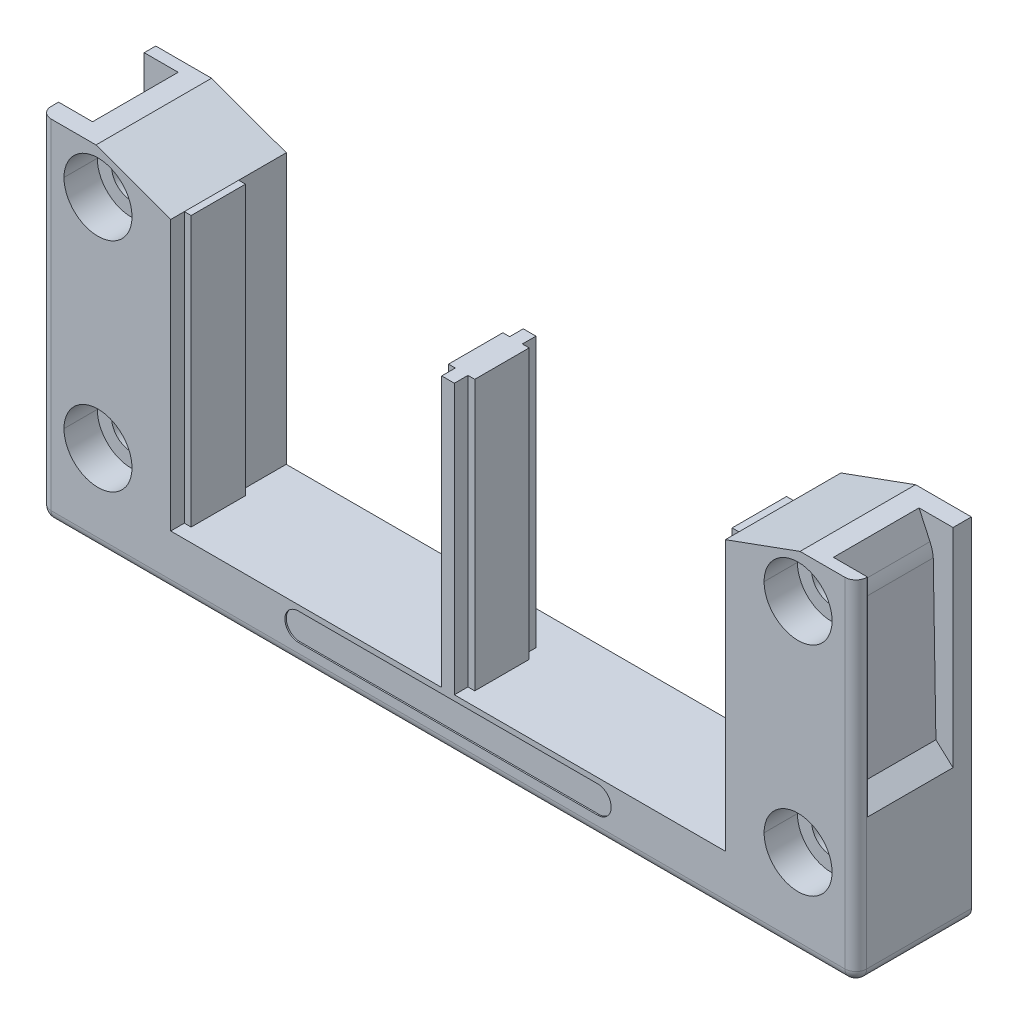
ISO-10303-21;
HEADER;
FILE_DESCRIPTION(('STEP AP214'),'2;1');
FILE_NAME('part.step','',(''),(''),'','','');
FILE_SCHEMA(('AUTOMOTIVE_DESIGN { 1 0 10303 214 1 1 1 1 }'));
ENDSEC;
DATA;
#1=APPLICATION_CONTEXT('core data for automotive mechanical design processes');
#2=APPLICATION_PROTOCOL_DEFINITION('international standard','automotive_design',2000,#1);
#3=PRODUCT_CONTEXT('',#1,'mechanical');
#4=PRODUCT('Part','Part','',(#3));
#5=PRODUCT_RELATED_PRODUCT_CATEGORY('part','',(#4));
#6=PRODUCT_DEFINITION_FORMATION('','',#4);
#7=PRODUCT_DEFINITION_CONTEXT('part definition',#1,'design');
#8=PRODUCT_DEFINITION('design','',#6,#7);
#9=PRODUCT_DEFINITION_SHAPE('','',#8);
#10=(LENGTH_UNIT() NAMED_UNIT(*) SI_UNIT(.MILLI.,.METRE.));
#11=(NAMED_UNIT(*) PLANE_ANGLE_UNIT() SI_UNIT($,.RADIAN.));
#12=(NAMED_UNIT(*) SI_UNIT($,.STERADIAN.) SOLID_ANGLE_UNIT());
#13=UNCERTAINTY_MEASURE_WITH_UNIT(LENGTH_MEASURE(1.E-05),#10,'distance_accuracy_value','');
#14=(GEOMETRIC_REPRESENTATION_CONTEXT(3) GLOBAL_UNCERTAINTY_ASSIGNED_CONTEXT((#13)) GLOBAL_UNIT_ASSIGNED_CONTEXT((#10,
#11,#12)) REPRESENTATION_CONTEXT('',''));
#15=CARTESIAN_POINT('',(0.,0.,0.));
#16=DIRECTION('',(0.,0.,1.));
#17=DIRECTION('',(1.,0.,0.));
#18=AXIS2_PLACEMENT_3D('',#15,#16,#17);
#19=CARTESIAN_POINT('',(-22.,-46.5,8.3));
#20=DIRECTION('',(0.,0.,1.));
#21=DIRECTION('',(1.,0.,0.));
#22=AXIS2_PLACEMENT_3D('',#19,#20,#21);
#23=PLANE('',#22);
#24=CARTESIAN_POINT('',(-22.,-46.5,8.3));
#25=DIRECTION('',(0.,0.,1.));
#26=DIRECTION('',(1.,0.,0.));
#27=AXIS2_PLACEMENT_3D('',#24,#25,#26);
#28=CIRCLE('',#27,2.);
#29=CARTESIAN_POINT('',(-22.,-44.5,8.3));
#30=VERTEX_POINT('',#29);
#31=CARTESIAN_POINT('',(-22.,-48.5,8.3));
#32=VERTEX_POINT('',#31);
#33=EDGE_CURVE('E729',#30,#32,#28,.T.);
#34=ORIENTED_EDGE('',*,*,#33,.T.);
#35=DIRECTION('',(1.,0.,0.));
#36=VECTOR('',#35,1.);
#37=CARTESIAN_POINT('',(-22.,-48.5,8.3));
#38=LINE('',#37,#36);
#39=CARTESIAN_POINT('',(22.,-48.5,8.3));
#40=VERTEX_POINT('',#39);
#41=EDGE_CURVE('E10',#32,#40,#38,.T.);
#42=ORIENTED_EDGE('',*,*,#41,.T.);
#43=CARTESIAN_POINT('',(22.,-46.5,8.3));
#44=DIRECTION('',(0.,0.,1.));
#45=DIRECTION('',(1.,0.,0.));
#46=AXIS2_PLACEMENT_3D('',#43,#44,#45);
#47=CIRCLE('',#46,2.);
#48=CARTESIAN_POINT('',(24.,-46.5,8.3));
#49=VERTEX_POINT('',#48);
#50=EDGE_CURVE('E735',#40,#49,#47,.T.);
#51=ORIENTED_EDGE('',*,*,#50,.T.);
#52=CARTESIAN_POINT('',(22.,-46.5,8.3));
#53=DIRECTION('',(0.,0.,1.));
#54=DIRECTION('',(1.,0.,0.));
#55=AXIS2_PLACEMENT_3D('',#52,#53,#54);
#56=CIRCLE('',#55,2.);
#57=CARTESIAN_POINT('',(22.,-44.5,8.3));
#58=VERTEX_POINT('',#57);
#59=EDGE_CURVE('E1285',#49,#58,#56,.T.);
#60=ORIENTED_EDGE('',*,*,#59,.T.);
#61=DIRECTION('',(-1.,0.,0.));
#62=VECTOR('',#61,1.);
#63=CARTESIAN_POINT('',(-22.,-44.5,8.3));
#64=LINE('',#63,#62);
#65=EDGE_CURVE('E40',#58,#30,#64,.T.);
#66=ORIENTED_EDGE('',*,*,#65,.T.);
#67=EDGE_LOOP('',(#34,#42,#51,#60,#66));
#68=FACE_BOUND('',#67,.T.);
#69=ADVANCED_FACE('F15',(#68),#23,.T.);
#70=CARTESIAN_POINT('',(-22.,-48.5,8.3));
#71=DIRECTION('',(0.,-1.,0.));
#72=DIRECTION('',(0.,0.,-1.));
#73=AXIS2_PLACEMENT_3D('',#70,#71,#72);
#74=PLANE('',#73);
#75=DIRECTION('',(1.,0.,0.));
#76=VECTOR('',#75,1.);
#77=CARTESIAN_POINT('',(-22.,-48.5,8.5));
#78=LINE('',#77,#76);
#79=CARTESIAN_POINT('',(-22.,-48.5,8.5));
#80=VERTEX_POINT('',#79);
#81=CARTESIAN_POINT('',(22.,-48.5,8.5));
#82=VERTEX_POINT('',#81);
#83=EDGE_CURVE('E749',#80,#82,#78,.T.);
#84=ORIENTED_EDGE('',*,*,#83,.T.);
#85=DIRECTION('',(0.,0.,1.));
#86=VECTOR('',#85,1.);
#87=CARTESIAN_POINT('',(22.,-48.5,8.3));
#88=LINE('',#87,#86);
#89=EDGE_CURVE('E23',#40,#82,#88,.T.);
#90=ORIENTED_EDGE('',*,*,#89,.F.);
#91=ORIENTED_EDGE('',*,*,#41,.F.);
#92=DIRECTION('',(0.,0.,1.));
#93=VECTOR('',#92,1.);
#94=CARTESIAN_POINT('',(-22.,-48.5,8.3));
#95=LINE('',#94,#93);
#96=EDGE_CURVE('E726',#32,#80,#95,.T.);
#97=ORIENTED_EDGE('',*,*,#96,.T.);
#98=EDGE_LOOP('',(#84,#90,#91,#97));
#99=FACE_BOUND('',#98,.T.);
#100=ADVANCED_FACE('F750',(#99),#74,.F.);
#101=CARTESIAN_POINT('',(22.,-46.5,8.3));
#102=DIRECTION('',(0.,0.,1.));
#103=DIRECTION('',(1.,0.,0.));
#104=AXIS2_PLACEMENT_3D('',#101,#102,#103);
#105=CYLINDRICAL_SURFACE('',#104,2.);
#106=DIRECTION('',(0.,0.,1.));
#107=VECTOR('',#106,1.);
#108=CARTESIAN_POINT('',(24.,-46.5,8.3));
#109=LINE('',#108,#107);
#110=CARTESIAN_POINT('',(24.,-46.5,8.5));
#111=VERTEX_POINT('',#110);
#112=EDGE_CURVE('E1278',#49,#111,#109,.T.);
#113=ORIENTED_EDGE('',*,*,#112,.F.);
#114=ORIENTED_EDGE('',*,*,#50,.F.);
#115=ORIENTED_EDGE('',*,*,#89,.T.);
#116=CARTESIAN_POINT('',(22.,-46.5,8.5));
#117=DIRECTION('',(0.,0.,1.));
#118=DIRECTION('',(1.,0.,0.));
#119=AXIS2_PLACEMENT_3D('',#116,#117,#118);
#120=CIRCLE('',#119,2.);
#121=EDGE_CURVE('E745',#82,#111,#120,.T.);
#122=ORIENTED_EDGE('',*,*,#121,.T.);
#123=EDGE_LOOP('',(#113,#114,#115,#122));
#124=FACE_BOUND('',#123,.T.);
#125=ADVANCED_FACE('F743',(#124),#105,.F.);
#126=CARTESIAN_POINT('',(-22.,-44.5,8.3));
#127=DIRECTION('',(0.,1.,0.));
#128=DIRECTION('',(1.,0.,0.));
#129=AXIS2_PLACEMENT_3D('',#126,#127,#128);
#130=PLANE('',#129);
#131=DIRECTION('',(-1.,0.,0.));
#132=VECTOR('',#131,1.);
#133=CARTESIAN_POINT('',(-22.,-44.5,8.5));
#134=LINE('',#133,#132);
#135=CARTESIAN_POINT('',(22.,-44.5,8.5));
#136=VERTEX_POINT('',#135);
#137=CARTESIAN_POINT('',(-22.,-44.5,8.5));
#138=VERTEX_POINT('',#137);
#139=EDGE_CURVE('E764',#136,#138,#134,.T.);
#140=ORIENTED_EDGE('',*,*,#139,.T.);
#141=DIRECTION('',(0.,0.,1.));
#142=VECTOR('',#141,1.);
#143=CARTESIAN_POINT('',(-22.,-44.5,8.3));
#144=LINE('',#143,#142);
#145=EDGE_CURVE('E732',#30,#138,#144,.T.);
#146=ORIENTED_EDGE('',*,*,#145,.F.);
#147=ORIENTED_EDGE('',*,*,#65,.F.);
#148=DIRECTION('',(0.,0.,1.));
#149=VECTOR('',#148,1.);
#150=CARTESIAN_POINT('',(22.,-44.5,8.3));
#151=LINE('',#150,#149);
#152=EDGE_CURVE('E1270',#58,#136,#151,.T.);
#153=ORIENTED_EDGE('',*,*,#152,.T.);
#154=EDGE_LOOP('',(#140,#146,#147,#153));
#155=FACE_BOUND('',#154,.T.);
#156=ADVANCED_FACE('F1271',(#155),#130,.F.);
#157=CARTESIAN_POINT('',(-22.,-46.5,8.3));
#158=DIRECTION('',(0.,0.,1.));
#159=DIRECTION('',(1.,0.,0.));
#160=AXIS2_PLACEMENT_3D('',#157,#158,#159);
#161=CYLINDRICAL_SURFACE('',#160,2.);
#162=CARTESIAN_POINT('',(-22.,-46.5,8.5));
#163=DIRECTION('',(0.,0.,1.));
#164=DIRECTION('',(1.,0.,0.));
#165=AXIS2_PLACEMENT_3D('',#162,#163,#164);
#166=CIRCLE('',#165,2.);
#167=EDGE_CURVE('E769',#138,#80,#166,.T.);
#168=ORIENTED_EDGE('',*,*,#167,.T.);
#169=ORIENTED_EDGE('',*,*,#96,.F.);
#170=ORIENTED_EDGE('',*,*,#33,.F.);
#171=ORIENTED_EDGE('',*,*,#145,.T.);
#172=EDGE_LOOP('',(#168,#169,#170,#171));
#173=FACE_BOUND('',#172,.T.);
#174=ADVANCED_FACE('F1265',(#173),#161,.F.);
#175=CARTESIAN_POINT('',(1.93333333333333,-56.3075814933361,-1.5));
#176=DIRECTION('',(-1.,0.,0.));
#177=DIRECTION('',(0.,0.,1.));
#178=AXIS2_PLACEMENT_3D('',#175,#176,#177);
#179=PLANE('',#178);
#180=DIRECTION('',(0.,1.,0.));
#181=VECTOR('',#180,1.);
#182=CARTESIAN_POINT('',(1.93333333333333,-56.3075814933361,6.5));
#183=LINE('',#182,#181);
#184=CARTESIAN_POINT('',(1.93333333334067,-43.7,6.5));
#185=VERTEX_POINT('',#184);
#186=CARTESIAN_POINT('',(1.93333333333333,-4.,6.5));
#187=VERTEX_POINT('',#186);
#188=EDGE_CURVE('E723',#185,#187,#183,.T.);
#189=ORIENTED_EDGE('',*,*,#188,.F.);
#190=DIRECTION('',(0.,0.,-1.));
#191=VECTOR('',#190,1.);
#192=CARTESIAN_POINT('',(1.93333333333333,-43.7,-1.5));
#193=LINE('',#192,#191);
#194=CARTESIAN_POINT('',(1.93333333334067,-43.7,-1.5));
#195=VERTEX_POINT('',#194);
#196=EDGE_CURVE('E868',#185,#195,#193,.T.);
#197=ORIENTED_EDGE('',*,*,#196,.T.);
#198=DIRECTION('',(0.,1.,0.));
#199=VECTOR('',#198,1.);
#200=CARTESIAN_POINT('',(1.93333333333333,-56.3075814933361,-1.5));
#201=LINE('',#200,#199);
#202=CARTESIAN_POINT('',(1.93333333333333,-4.,-1.5));
#203=VERTEX_POINT('',#202);
#204=EDGE_CURVE('E696',#195,#203,#201,.T.);
#205=ORIENTED_EDGE('',*,*,#204,.T.);
#206=DIRECTION('',(0.,0.,1.));
#207=VECTOR('',#206,1.);
#208=CARTESIAN_POINT('',(1.93333333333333,-4.,-1.5));
#209=LINE('',#208,#207);
#210=EDGE_CURVE('E653',#203,#187,#209,.T.);
#211=ORIENTED_EDGE('',*,*,#210,.T.);
#212=EDGE_LOOP('',(#189,#197,#205,#211));
#213=FACE_BOUND('',#212,.T.);
#214=ADVANCED_FACE('F1441',(#213),#179,.F.);
#215=CARTESIAN_POINT('',(1.93333333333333,-56.3075814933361,6.5));
#216=DIRECTION('',(0.,0.,-1.));
#217=DIRECTION('',(0.,-1.,0.));
#218=AXIS2_PLACEMENT_3D('',#215,#216,#217);
#219=PLANE('',#218);
#220=DIRECTION('',(0.,1.,0.));
#221=VECTOR('',#220,1.);
#222=CARTESIAN_POINT('',(0.933333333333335,-56.3075814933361,6.5));
#223=LINE('',#222,#221);
#224=CARTESIAN_POINT('',(0.933333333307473,-43.7,6.5));
#225=VERTEX_POINT('',#224);
#226=CARTESIAN_POINT('',(0.933333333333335,-4.,6.5));
#227=VERTEX_POINT('',#226);
#228=EDGE_CURVE('E720',#225,#227,#223,.T.);
#229=ORIENTED_EDGE('',*,*,#228,.F.);
#230=DIRECTION('',(1.,0.,0.));
#231=VECTOR('',#230,1.);
#232=CARTESIAN_POINT('',(1.93333333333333,-43.7,6.5));
#233=LINE('',#232,#231);
#234=EDGE_CURVE('E872',#225,#185,#233,.T.);
#235=ORIENTED_EDGE('',*,*,#234,.T.);
#236=ORIENTED_EDGE('',*,*,#188,.T.);
#237=DIRECTION('',(-1.,0.,0.));
#238=VECTOR('',#237,1.);
#239=CARTESIAN_POINT('',(1.93333333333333,-4.,6.5));
#240=LINE('',#239,#238);
#241=EDGE_CURVE('E692',#187,#227,#240,.T.);
#242=ORIENTED_EDGE('',*,*,#241,.T.);
#243=EDGE_LOOP('',(#229,#235,#236,#242));
#244=FACE_BOUND('',#243,.T.);
#245=ADVANCED_FACE('F1437',(#244),#219,.F.);
#246=CARTESIAN_POINT('',(0.933333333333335,-56.3075814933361,6.5));
#247=DIRECTION('',(-1.,0.,0.));
#248=DIRECTION('',(0.,0.,1.));
#249=AXIS2_PLACEMENT_3D('',#246,#247,#248);
#250=PLANE('',#249);
#251=DIRECTION('',(0.,1.,0.));
#252=VECTOR('',#251,1.);
#253=CARTESIAN_POINT('',(0.933333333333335,-56.3075814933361,8.5));
#254=LINE('',#253,#252);
#255=CARTESIAN_POINT('',(0.933333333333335,-43.7,8.5));
#256=VERTEX_POINT('',#255);
#257=CARTESIAN_POINT('',(0.933333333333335,-4.,8.5));
#258=VERTEX_POINT('',#257);
#259=EDGE_CURVE('E1085',#256,#258,#254,.T.);
#260=ORIENTED_EDGE('',*,*,#259,.F.);
#261=DIRECTION('',(0.,0.,-1.));
#262=VECTOR('',#261,1.);
#263=CARTESIAN_POINT('',(0.933333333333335,-43.7,6.5));
#264=LINE('',#263,#262);
#265=EDGE_CURVE('E873',#256,#225,#264,.T.);
#266=ORIENTED_EDGE('',*,*,#265,.T.);
#267=ORIENTED_EDGE('',*,*,#228,.T.);
#268=DIRECTION('',(0.,0.,1.));
#269=VECTOR('',#268,1.);
#270=CARTESIAN_POINT('',(0.933333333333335,-4.,6.5));
#271=LINE('',#270,#269);
#272=EDGE_CURVE('E689',#227,#258,#271,.T.);
#273=ORIENTED_EDGE('',*,*,#272,.T.);
#274=EDGE_LOOP('',(#260,#266,#267,#273));
#275=FACE_BOUND('',#274,.T.);
#276=ADVANCED_FACE('F1433',(#275),#250,.F.);
#277=CARTESIAN_POINT('',(-0.933333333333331,-56.3075814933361,6.5));
#278=DIRECTION('',(1.,0.,0.));
#279=DIRECTION('',(0.,1.,0.));
#280=AXIS2_PLACEMENT_3D('',#277,#278,#279);
#281=PLANE('',#280);
#282=DIRECTION('',(0.,1.,0.));
#283=VECTOR('',#282,1.);
#284=CARTESIAN_POINT('',(-0.933333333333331,-56.3075814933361,6.5));
#285=LINE('',#284,#283);
#286=CARTESIAN_POINT('',(-0.933333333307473,-43.7,6.5));
#287=VERTEX_POINT('',#286);
#288=CARTESIAN_POINT('',(-0.933333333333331,-4.,6.5));
#289=VERTEX_POINT('',#288);
#290=EDGE_CURVE('E717',#287,#289,#285,.T.);
#291=ORIENTED_EDGE('',*,*,#290,.F.);
#292=DIRECTION('',(0.,0.,1.));
#293=VECTOR('',#292,1.);
#294=CARTESIAN_POINT('',(-0.933333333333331,-43.7,6.5));
#295=LINE('',#294,#293);
#296=CARTESIAN_POINT('',(-0.93333333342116,-43.7,8.5));
#297=VERTEX_POINT('',#296);
#298=EDGE_CURVE('E851',#287,#297,#295,.T.);
#299=ORIENTED_EDGE('',*,*,#298,.T.);
#300=DIRECTION('',(0.,1.,0.));
#301=VECTOR('',#300,1.);
#302=CARTESIAN_POINT('',(-0.933333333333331,-56.3075814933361,8.5));
#303=LINE('',#302,#301);
#304=CARTESIAN_POINT('',(-0.933333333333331,-4.,8.5));
#305=VERTEX_POINT('',#304);
#306=EDGE_CURVE('E1189',#297,#305,#303,.T.);
#307=ORIENTED_EDGE('',*,*,#306,.T.);
#308=DIRECTION('',(0.,0.,-1.));
#309=VECTOR('',#308,1.);
#310=CARTESIAN_POINT('',(-0.933333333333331,-4.,6.5));
#311=LINE('',#310,#309);
#312=EDGE_CURVE('E685',#305,#289,#311,.T.);
#313=ORIENTED_EDGE('',*,*,#312,.T.);
#314=EDGE_LOOP('',(#291,#299,#307,#313));
#315=FACE_BOUND('',#314,.T.);
#316=ADVANCED_FACE('F1429',(#315),#281,.F.);
#317=CARTESIAN_POINT('',(-0.933333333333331,-56.3075814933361,6.5));
#318=DIRECTION('',(0.,0.,-1.));
#319=DIRECTION('',(0.,-1.,0.));
#320=AXIS2_PLACEMENT_3D('',#317,#318,#319);
#321=PLANE('',#320);
#322=DIRECTION('',(0.,1.,0.));
#323=VECTOR('',#322,1.);
#324=CARTESIAN_POINT('',(-1.93333333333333,-56.3075814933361,6.5));
#325=LINE('',#324,#323);
#326=CARTESIAN_POINT('',(-1.93333333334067,-43.7,6.5));
#327=VERTEX_POINT('',#326);
#328=CARTESIAN_POINT('',(-1.93333333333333,-4.,6.5));
#329=VERTEX_POINT('',#328);
#330=EDGE_CURVE('E714',#327,#329,#325,.T.);
#331=ORIENTED_EDGE('',*,*,#330,.F.);
#332=DIRECTION('',(1.,0.,0.));
#333=VECTOR('',#332,1.);
#334=CARTESIAN_POINT('',(-0.933333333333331,-43.7,6.5));
#335=LINE('',#334,#333);
#336=EDGE_CURVE('E857',#327,#287,#335,.T.);
#337=ORIENTED_EDGE('',*,*,#336,.T.);
#338=ORIENTED_EDGE('',*,*,#290,.T.);
#339=DIRECTION('',(-1.,0.,0.));
#340=VECTOR('',#339,1.);
#341=CARTESIAN_POINT('',(-0.933333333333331,-4.,6.5));
#342=LINE('',#341,#340);
#343=EDGE_CURVE('E681',#289,#329,#342,.T.);
#344=ORIENTED_EDGE('',*,*,#343,.T.);
#345=EDGE_LOOP('',(#331,#337,#338,#344));
#346=FACE_BOUND('',#345,.T.);
#347=ADVANCED_FACE('F1432',(#346),#321,.F.);
#348=CARTESIAN_POINT('',(-1.93333333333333,-56.3075814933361,-1.5));
#349=DIRECTION('',(1.,0.,0.));
#350=DIRECTION('',(0.,1.,0.));
#351=AXIS2_PLACEMENT_3D('',#348,#349,#350);
#352=PLANE('',#351);
#353=DIRECTION('',(0.,1.,0.));
#354=VECTOR('',#353,1.);
#355=CARTESIAN_POINT('',(-1.93333333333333,-56.3075814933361,-1.5));
#356=LINE('',#355,#354);
#357=CARTESIAN_POINT('',(-1.93333333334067,-43.7,-1.5));
#358=VERTEX_POINT('',#357);
#359=CARTESIAN_POINT('',(-1.93333333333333,-4.,-1.5));
#360=VERTEX_POINT('',#359);
#361=EDGE_CURVE('E711',#358,#360,#356,.T.);
#362=ORIENTED_EDGE('',*,*,#361,.F.);
#363=DIRECTION('',(0.,0.,1.));
#364=VECTOR('',#363,1.);
#365=CARTESIAN_POINT('',(-1.93333333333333,-43.7,-1.5));
#366=LINE('',#365,#364);
#367=EDGE_CURVE('E852',#358,#327,#366,.T.);
#368=ORIENTED_EDGE('',*,*,#367,.T.);
#369=ORIENTED_EDGE('',*,*,#330,.T.);
#370=DIRECTION('',(0.,0.,-1.));
#371=VECTOR('',#370,1.);
#372=CARTESIAN_POINT('',(-1.93333333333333,-4.,-1.5));
#373=LINE('',#372,#371);
#374=EDGE_CURVE('E677',#329,#360,#373,.T.);
#375=ORIENTED_EDGE('',*,*,#374,.T.);
#376=EDGE_LOOP('',(#362,#368,#369,#375));
#377=FACE_BOUND('',#376,.T.);
#378=ADVANCED_FACE('F1427',(#377),#352,.F.);
#379=CARTESIAN_POINT('',(-0.933333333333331,-56.3075814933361,-1.5));
#380=DIRECTION('',(0.,0.,1.));
#381=DIRECTION('',(0.,-1.,0.));
#382=AXIS2_PLACEMENT_3D('',#379,#380,#381);
#383=PLANE('',#382);
#384=DIRECTION('',(0.,1.,0.));
#385=VECTOR('',#384,1.);
#386=CARTESIAN_POINT('',(-0.933333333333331,-56.3075814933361,-1.5));
#387=LINE('',#386,#385);
#388=CARTESIAN_POINT('',(-0.933333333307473,-43.7,-1.5));
#389=VERTEX_POINT('',#388);
#390=CARTESIAN_POINT('',(-0.933333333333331,-4.,-1.5));
#391=VERTEX_POINT('',#390);
#392=EDGE_CURVE('E708',#389,#391,#387,.T.);
#393=ORIENTED_EDGE('',*,*,#392,.F.);
#394=DIRECTION('',(-1.,0.,0.));
#395=VECTOR('',#394,1.);
#396=CARTESIAN_POINT('',(-0.933333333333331,-43.7,-1.5));
#397=LINE('',#396,#395);
#398=EDGE_CURVE('E856',#389,#358,#397,.T.);
#399=ORIENTED_EDGE('',*,*,#398,.T.);
#400=ORIENTED_EDGE('',*,*,#361,.T.);
#401=DIRECTION('',(1.,0.,0.));
#402=VECTOR('',#401,1.);
#403=CARTESIAN_POINT('',(-0.933333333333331,-4.,-1.5));
#404=LINE('',#403,#402);
#405=EDGE_CURVE('E673',#360,#391,#404,.T.);
#406=ORIENTED_EDGE('',*,*,#405,.T.);
#407=EDGE_LOOP('',(#393,#399,#400,#406));
#408=FACE_BOUND('',#407,.T.);
#409=ADVANCED_FACE('F1423',(#408),#383,.F.);
#410=CARTESIAN_POINT('',(-0.933333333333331,-56.3075814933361,-3.5));
#411=DIRECTION('',(1.,0.,0.));
#412=DIRECTION('',(0.,1.,0.));
#413=AXIS2_PLACEMENT_3D('',#410,#411,#412);
#414=PLANE('',#413);
#415=DIRECTION('',(0.,1.,0.));
#416=VECTOR('',#415,1.);
#417=CARTESIAN_POINT('',(-0.933333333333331,-56.3075814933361,-3.5));
#418=LINE('',#417,#416);
#419=CARTESIAN_POINT('',(-0.933333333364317,-43.7,-3.5));
#420=VERTEX_POINT('',#419);
#421=CARTESIAN_POINT('',(-0.933333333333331,-4.,-3.5));
#422=VERTEX_POINT('',#421);
#423=EDGE_CURVE('E705',#420,#422,#418,.T.);
#424=ORIENTED_EDGE('',*,*,#423,.F.);
#425=DIRECTION('',(0.,0.,1.));
#426=VECTOR('',#425,1.);
#427=CARTESIAN_POINT('',(-0.933333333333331,-43.7,-3.5));
#428=LINE('',#427,#426);
#429=EDGE_CURVE('E863',#420,#389,#428,.T.);
#430=ORIENTED_EDGE('',*,*,#429,.T.);
#431=ORIENTED_EDGE('',*,*,#392,.T.);
#432=DIRECTION('',(0.,0.,-1.));
#433=VECTOR('',#432,1.);
#434=CARTESIAN_POINT('',(-0.933333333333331,-4.,-3.5));
#435=LINE('',#434,#433);
#436=EDGE_CURVE('E669',#391,#422,#435,.T.);
#437=ORIENTED_EDGE('',*,*,#436,.T.);
#438=EDGE_LOOP('',(#424,#430,#431,#437));
#439=FACE_BOUND('',#438,.T.);
#440=ADVANCED_FACE('F1419',(#439),#414,.F.);
#441=CARTESIAN_POINT('',(0.933333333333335,-56.3075814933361,-3.5));
#442=DIRECTION('',(0.,0.,1.));
#443=DIRECTION('',(1.,0.,0.));
#444=AXIS2_PLACEMENT_3D('',#441,#442,#443);
#445=PLANE('',#444);
#446=DIRECTION('',(0.,1.,0.));
#447=VECTOR('',#446,1.);
#448=CARTESIAN_POINT('',(0.933333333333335,-56.3075814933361,-3.5));
#449=LINE('',#448,#447);
#450=CARTESIAN_POINT('',(0.933333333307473,-43.7,-3.5));
#451=VERTEX_POINT('',#450);
#452=CARTESIAN_POINT('',(0.933333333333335,-4.,-3.5));
#453=VERTEX_POINT('',#452);
#454=EDGE_CURVE('E702',#451,#453,#449,.T.);
#455=ORIENTED_EDGE('',*,*,#454,.F.);
#456=DIRECTION('',(-1.,0.,0.));
#457=VECTOR('',#456,1.);
#458=CARTESIAN_POINT('',(0.933333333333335,-43.7,-3.5));
#459=LINE('',#458,#457);
#460=EDGE_CURVE('E858',#451,#420,#459,.T.);
#461=ORIENTED_EDGE('',*,*,#460,.T.);
#462=ORIENTED_EDGE('',*,*,#423,.T.);
#463=DIRECTION('',(1.,0.,0.));
#464=VECTOR('',#463,1.);
#465=CARTESIAN_POINT('',(0.933333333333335,-4.,-3.5));
#466=LINE('',#465,#464);
#467=EDGE_CURVE('E665',#422,#453,#466,.T.);
#468=ORIENTED_EDGE('',*,*,#467,.T.);
#469=EDGE_LOOP('',(#455,#461,#462,#468));
#470=FACE_BOUND('',#469,.T.);
#471=ADVANCED_FACE('F1415',(#470),#445,.F.);
#472=CARTESIAN_POINT('',(0.933333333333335,-56.3075814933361,-3.5));
#473=DIRECTION('',(-1.,0.,0.));
#474=DIRECTION('',(0.,0.,1.));
#475=AXIS2_PLACEMENT_3D('',#472,#473,#474);
#476=PLANE('',#475);
#477=DIRECTION('',(0.,1.,0.));
#478=VECTOR('',#477,1.);
#479=CARTESIAN_POINT('',(0.933333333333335,-56.3075814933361,-1.5));
#480=LINE('',#479,#478);
#481=CARTESIAN_POINT('',(0.933333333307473,-43.7,-1.5));
#482=VERTEX_POINT('',#481);
#483=CARTESIAN_POINT('',(0.933333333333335,-4.,-1.5));
#484=VERTEX_POINT('',#483);
#485=EDGE_CURVE('E699',#482,#484,#480,.T.);
#486=ORIENTED_EDGE('',*,*,#485,.F.);
#487=DIRECTION('',(0.,0.,-1.));
#488=VECTOR('',#487,1.);
#489=CARTESIAN_POINT('',(0.933333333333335,-43.7,-3.5));
#490=LINE('',#489,#488);
#491=EDGE_CURVE('E862',#482,#451,#490,.T.);
#492=ORIENTED_EDGE('',*,*,#491,.T.);
#493=ORIENTED_EDGE('',*,*,#454,.T.);
#494=DIRECTION('',(0.,0.,1.));
#495=VECTOR('',#494,1.);
#496=CARTESIAN_POINT('',(0.933333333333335,-4.,-3.5));
#497=LINE('',#496,#495);
#498=EDGE_CURVE('E661',#453,#484,#497,.T.);
#499=ORIENTED_EDGE('',*,*,#498,.T.);
#500=EDGE_LOOP('',(#486,#492,#493,#499));
#501=FACE_BOUND('',#500,.T.);
#502=ADVANCED_FACE('F1418',(#501),#476,.F.);
#503=CARTESIAN_POINT('',(1.93333333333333,-56.3075814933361,-1.5));
#504=DIRECTION('',(0.,0.,1.));
#505=DIRECTION('',(1.,0.,0.));
#506=AXIS2_PLACEMENT_3D('',#503,#504,#505);
#507=PLANE('',#506);
#508=ORIENTED_EDGE('',*,*,#204,.F.);
#509=DIRECTION('',(-1.,0.,0.));
#510=VECTOR('',#509,1.);
#511=CARTESIAN_POINT('',(1.93333333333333,-43.7,-1.5));
#512=LINE('',#511,#510);
#513=EDGE_CURVE('E864',#195,#482,#512,.T.);
#514=ORIENTED_EDGE('',*,*,#513,.T.);
#515=ORIENTED_EDGE('',*,*,#485,.T.);
#516=DIRECTION('',(1.,0.,0.));
#517=VECTOR('',#516,1.);
#518=CARTESIAN_POINT('',(1.93333333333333,-4.,-1.5));
#519=LINE('',#518,#517);
#520=EDGE_CURVE('E657',#484,#203,#519,.T.);
#521=ORIENTED_EDGE('',*,*,#520,.T.);
#522=EDGE_LOOP('',(#508,#514,#515,#521));
#523=FACE_BOUND('',#522,.T.);
#524=ADVANCED_FACE('F1413',(#523),#507,.F.);
#525=CARTESIAN_POINT('',(0.,-4.,0.));
#526=DIRECTION('',(0.,-1.,0.));
#527=DIRECTION('',(0.,0.,-1.));
#528=AXIS2_PLACEMENT_3D('',#525,#526,#527);
#529=PLANE('',#528);
#530=ORIENTED_EDGE('',*,*,#210,.F.);
#531=ORIENTED_EDGE('',*,*,#520,.F.);
#532=ORIENTED_EDGE('',*,*,#498,.F.);
#533=ORIENTED_EDGE('',*,*,#467,.F.);
#534=ORIENTED_EDGE('',*,*,#436,.F.);
#535=ORIENTED_EDGE('',*,*,#405,.F.);
#536=ORIENTED_EDGE('',*,*,#374,.F.);
#537=ORIENTED_EDGE('',*,*,#343,.F.);
#538=ORIENTED_EDGE('',*,*,#312,.F.);
#539=DIRECTION('',(-1.,0.,0.));
#540=VECTOR('',#539,1.);
#541=CARTESIAN_POINT('',(0.933333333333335,-4.,8.5));
#542=LINE('',#541,#540);
#543=EDGE_CURVE('E1089',#258,#305,#542,.T.);
#544=ORIENTED_EDGE('',*,*,#543,.F.);
#545=ORIENTED_EDGE('',*,*,#272,.F.);
#546=ORIENTED_EDGE('',*,*,#241,.F.);
#547=EDGE_LOOP('',(#530,#531,#532,#533,#534,#535,#536,#537,#538,#544,#545,#546));
#548=FACE_BOUND('',#547,.T.);
#549=ADVANCED_FACE('F1409',(#548),#529,.F.);
#550=CARTESIAN_POINT('',(39.8,-56.3075814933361,-1.5));
#551=DIRECTION('',(0.,0.,1.));
#552=DIRECTION('',(0.,-1.,0.));
#553=AXIS2_PLACEMENT_3D('',#550,#551,#552);
#554=PLANE('',#553);
#555=DIRECTION('',(0.,1.,0.));
#556=VECTOR('',#555,1.);
#557=CARTESIAN_POINT('',(40.8,-56.3075814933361,-1.5));
#558=LINE('',#557,#556);
#559=CARTESIAN_POINT('',(40.7999999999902,-43.7,-1.5));
#560=VERTEX_POINT('',#559);
#561=CARTESIAN_POINT('',(40.8,-4.,-1.5));
#562=VERTEX_POINT('',#561);
#563=EDGE_CURVE('E887',#560,#562,#558,.T.);
#564=ORIENTED_EDGE('',*,*,#563,.F.);
#565=DIRECTION('',(-1.,0.,0.));
#566=VECTOR('',#565,1.);
#567=CARTESIAN_POINT('',(39.8,-43.7,-1.5));
#568=LINE('',#567,#566);
#569=CARTESIAN_POINT('',(39.799999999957,-43.7,-1.5));
#570=VERTEX_POINT('',#569);
#571=EDGE_CURVE('E883',#560,#570,#568,.T.);
#572=ORIENTED_EDGE('',*,*,#571,.T.);
#573=DIRECTION('',(0.,1.,0.));
#574=VECTOR('',#573,1.);
#575=CARTESIAN_POINT('',(39.8,-56.3075814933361,-1.5));
#576=LINE('',#575,#574);
#577=CARTESIAN_POINT('',(39.8,-4.,-1.5));
#578=VERTEX_POINT('',#577);
#579=EDGE_CURVE('E647',#570,#578,#576,.T.);
#580=ORIENTED_EDGE('',*,*,#579,.T.);
#581=DIRECTION('',(1.,0.,0.));
#582=VECTOR('',#581,1.);
#583=CARTESIAN_POINT('',(39.8,-4.,-1.5));
#584=LINE('',#583,#582);
#585=EDGE_CURVE('E636',#578,#562,#584,.T.);
#586=ORIENTED_EDGE('',*,*,#585,.T.);
#587=EDGE_LOOP('',(#564,#572,#580,#586));
#588=FACE_BOUND('',#587,.T.);
#589=ADVANCED_FACE('F1405',(#588),#554,.F.);
#590=CARTESIAN_POINT('',(39.8,-56.3075814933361,6.5));
#591=DIRECTION('',(0.,0.,-1.));
#592=DIRECTION('',(0.,-1.,0.));
#593=AXIS2_PLACEMENT_3D('',#590,#591,#592);
#594=PLANE('',#593);
#595=DIRECTION('',(0.,1.,0.));
#596=VECTOR('',#595,1.);
#597=CARTESIAN_POINT('',(39.8,-56.3075814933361,6.5));
#598=LINE('',#597,#596);
#599=CARTESIAN_POINT('',(39.8000000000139,-43.7,6.5));
#600=VERTEX_POINT('',#599);
#601=CARTESIAN_POINT('',(39.8,-4.,6.5));
#602=VERTEX_POINT('',#601);
#603=EDGE_CURVE('E650',#600,#602,#598,.T.);
#604=ORIENTED_EDGE('',*,*,#603,.F.);
#605=DIRECTION('',(1.,0.,0.));
#606=VECTOR('',#605,1.);
#607=CARTESIAN_POINT('',(39.8,-43.7,6.5));
#608=LINE('',#607,#606);
#609=CARTESIAN_POINT('',(40.7999999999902,-43.7,6.5));
#610=VERTEX_POINT('',#609);
#611=EDGE_CURVE('E1224',#600,#610,#608,.T.);
#612=ORIENTED_EDGE('',*,*,#611,.T.);
#613=DIRECTION('',(0.,1.,0.));
#614=VECTOR('',#613,1.);
#615=CARTESIAN_POINT('',(40.8,-56.3075814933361,6.5));
#616=LINE('',#615,#614);
#617=CARTESIAN_POINT('',(40.8,-4.,6.5));
#618=VERTEX_POINT('',#617);
#619=EDGE_CURVE('E878',#610,#618,#616,.T.);
#620=ORIENTED_EDGE('',*,*,#619,.T.);
#621=DIRECTION('',(-1.,0.,0.));
#622=VECTOR('',#621,1.);
#623=CARTESIAN_POINT('',(39.8,-4.,6.5));
#624=LINE('',#623,#622);
#625=EDGE_CURVE('E643',#618,#602,#624,.T.);
#626=ORIENTED_EDGE('',*,*,#625,.T.);
#627=EDGE_LOOP('',(#604,#612,#620,#626));
#628=FACE_BOUND('',#627,.T.);
#629=ADVANCED_FACE('F1402',(#628),#594,.F.);
#630=CARTESIAN_POINT('',(39.8,-56.3075814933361,-1.5));
#631=DIRECTION('',(1.,0.,0.));
#632=DIRECTION('',(0.,1.,0.));
#633=AXIS2_PLACEMENT_3D('',#630,#631,#632);
#634=PLANE('',#633);
#635=ORIENTED_EDGE('',*,*,#579,.F.);
#636=DIRECTION('',(0.,0.,1.));
#637=VECTOR('',#636,1.);
#638=CARTESIAN_POINT('',(39.8,-43.7,-1.5));
#639=LINE('',#638,#637);
#640=EDGE_CURVE('E1236',#570,#600,#639,.T.);
#641=ORIENTED_EDGE('',*,*,#640,.T.);
#642=ORIENTED_EDGE('',*,*,#603,.T.);
#643=DIRECTION('',(0.,0.,-1.));
#644=VECTOR('',#643,1.);
#645=CARTESIAN_POINT('',(39.8,-4.,-1.5));
#646=LINE('',#645,#644);
#647=EDGE_CURVE('E639',#602,#578,#646,.T.);
#648=ORIENTED_EDGE('',*,*,#647,.T.);
#649=EDGE_LOOP('',(#635,#641,#642,#648));
#650=FACE_BOUND('',#649,.T.);
#651=ADVANCED_FACE('F1400',(#650),#634,.F.);
#652=CARTESIAN_POINT('',(0.,-4.,0.));
#653=DIRECTION('',(0.,-1.,0.));
#654=DIRECTION('',(0.,0.,-1.));
#655=AXIS2_PLACEMENT_3D('',#652,#653,#654);
#656=PLANE('',#655);
#657=ORIENTED_EDGE('',*,*,#585,.F.);
#658=ORIENTED_EDGE('',*,*,#647,.F.);
#659=ORIENTED_EDGE('',*,*,#625,.F.);
#660=DIRECTION('',(0.,0.,1.));
#661=VECTOR('',#660,1.);
#662=CARTESIAN_POINT('',(40.8,-4.,-1.5));
#663=LINE('',#662,#661);
#664=EDGE_CURVE('E980',#562,#618,#663,.T.);
#665=ORIENTED_EDGE('',*,*,#664,.F.);
#666=EDGE_LOOP('',(#657,#658,#659,#665));
#667=FACE_BOUND('',#666,.T.);
#668=ADVANCED_FACE('F2101',(#667),#656,.F.);
#669=CARTESIAN_POINT('',(-40.8,-56.3075814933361,-1.5));
#670=DIRECTION('',(0.,0.,1.));
#671=DIRECTION('',(0.,-1.,0.));
#672=AXIS2_PLACEMENT_3D('',#669,#670,#671);
#673=PLANE('',#672);
#674=DIRECTION('',(0.,1.,0.));
#675=VECTOR('',#674,1.);
#676=CARTESIAN_POINT('',(-39.8,-56.3075814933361,-1.5));
#677=LINE('',#676,#675);
#678=CARTESIAN_POINT('',(-39.799999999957,-43.7,-1.5));
#679=VERTEX_POINT('',#678);
#680=CARTESIAN_POINT('',(-39.8,-4.,-1.5));
#681=VERTEX_POINT('',#680);
#682=EDGE_CURVE('E633',#679,#681,#677,.T.);
#683=ORIENTED_EDGE('',*,*,#682,.F.);
#684=DIRECTION('',(-1.,0.,0.));
#685=VECTOR('',#684,1.);
#686=CARTESIAN_POINT('',(-40.8,-43.7,-1.5));
#687=LINE('',#686,#685);
#688=CARTESIAN_POINT('',(-40.8,-43.7,-1.5));
#689=VERTEX_POINT('',#688);
#690=EDGE_CURVE('E826',#679,#689,#687,.T.);
#691=ORIENTED_EDGE('',*,*,#690,.T.);
#692=DIRECTION('',(0.,1.,0.));
#693=VECTOR('',#692,1.);
#694=CARTESIAN_POINT('',(-40.8,-56.3075814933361,-1.5));
#695=LINE('',#694,#693);
#696=CARTESIAN_POINT('',(-40.8,-4.,-1.5));
#697=VERTEX_POINT('',#696);
#698=EDGE_CURVE('E784',#689,#697,#695,.T.);
#699=ORIENTED_EDGE('',*,*,#698,.T.);
#700=DIRECTION('',(1.,0.,0.));
#701=VECTOR('',#700,1.);
#702=CARTESIAN_POINT('',(-40.8,-4.,-1.5));
#703=LINE('',#702,#701);
#704=EDGE_CURVE('E624',#697,#681,#703,.T.);
#705=ORIENTED_EDGE('',*,*,#704,.T.);
#706=EDGE_LOOP('',(#683,#691,#699,#705));
#707=FACE_BOUND('',#706,.T.);
#708=ADVANCED_FACE('F2090',(#707),#673,.F.);
#709=CARTESIAN_POINT('',(-39.8,-56.3075814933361,-1.5));
#710=DIRECTION('',(-1.,0.,0.));
#711=DIRECTION('',(0.,0.,1.));
#712=AXIS2_PLACEMENT_3D('',#709,#710,#711);
#713=PLANE('',#712);
#714=DIRECTION('',(0.,1.,0.));
#715=VECTOR('',#714,1.);
#716=CARTESIAN_POINT('',(-39.8,-56.3075814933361,6.5));
#717=LINE('',#716,#715);
#718=CARTESIAN_POINT('',(-39.8,-43.7,6.5));
#719=VERTEX_POINT('',#718);
#720=CARTESIAN_POINT('',(-39.8,-4.,6.5));
#721=VERTEX_POINT('',#720);
#722=EDGE_CURVE('E629',#719,#721,#717,.T.);
#723=ORIENTED_EDGE('',*,*,#722,.F.);
#724=DIRECTION('',(0.,0.,-1.));
#725=VECTOR('',#724,1.);
#726=CARTESIAN_POINT('',(-39.8,-43.7,-1.5));
#727=LINE('',#726,#725);
#728=EDGE_CURVE('E834',#719,#679,#727,.T.);
#729=ORIENTED_EDGE('',*,*,#728,.T.);
#730=ORIENTED_EDGE('',*,*,#682,.T.);
#731=DIRECTION('',(0.,0.,1.));
#732=VECTOR('',#731,1.);
#733=CARTESIAN_POINT('',(-39.8,-4.,-1.5));
#734=LINE('',#733,#732);
#735=EDGE_CURVE('E625',#681,#721,#734,.T.);
#736=ORIENTED_EDGE('',*,*,#735,.T.);
#737=EDGE_LOOP('',(#723,#729,#730,#736));
#738=FACE_BOUND('',#737,.T.);
#739=ADVANCED_FACE('F2080',(#738),#713,.F.);
#740=CARTESIAN_POINT('',(-40.8,-56.3075814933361,6.5));
#741=DIRECTION('',(0.,0.,-1.));
#742=DIRECTION('',(-1.,0.,0.));
#743=AXIS2_PLACEMENT_3D('',#740,#741,#742);
#744=PLANE('',#743);
#745=DIRECTION('',(0.,1.,0.));
#746=VECTOR('',#745,1.);
#747=CARTESIAN_POINT('',(-40.8,-56.3075814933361,6.5));
#748=LINE('',#747,#746);
#749=CARTESIAN_POINT('',(-40.8,-43.7,6.5));
#750=VERTEX_POINT('',#749);
#751=CARTESIAN_POINT('',(-40.8,-4.,6.5));
#752=VERTEX_POINT('',#751);
#753=EDGE_CURVE('E899',#750,#752,#748,.T.);
#754=ORIENTED_EDGE('',*,*,#753,.F.);
#755=DIRECTION('',(1.,0.,0.));
#756=VECTOR('',#755,1.);
#757=CARTESIAN_POINT('',(-40.8,-43.7,6.5));
#758=LINE('',#757,#756);
#759=EDGE_CURVE('E842',#750,#719,#758,.T.);
#760=ORIENTED_EDGE('',*,*,#759,.T.);
#761=ORIENTED_EDGE('',*,*,#722,.T.);
#762=DIRECTION('',(-1.,0.,0.));
#763=VECTOR('',#762,1.);
#764=CARTESIAN_POINT('',(-40.8,-4.,6.5));
#765=LINE('',#764,#763);
#766=EDGE_CURVE('E630',#721,#752,#765,.T.);
#767=ORIENTED_EDGE('',*,*,#766,.T.);
#768=EDGE_LOOP('',(#754,#760,#761,#767));
#769=FACE_BOUND('',#768,.T.);
#770=ADVANCED_FACE('F2070',(#769),#744,.F.);
#771=CARTESIAN_POINT('',(0.,-4.,0.));
#772=DIRECTION('',(0.,-1.,0.));
#773=DIRECTION('',(0.,0.,-1.));
#774=AXIS2_PLACEMENT_3D('',#771,#772,#773);
#775=PLANE('',#774);
#776=ORIENTED_EDGE('',*,*,#704,.F.);
#777=DIRECTION('',(0.,0.,-1.));
#778=VECTOR('',#777,1.);
#779=CARTESIAN_POINT('',(-40.8,-4.,-1.5));
#780=LINE('',#779,#778);
#781=EDGE_CURVE('E806',#752,#697,#780,.T.);
#782=ORIENTED_EDGE('',*,*,#781,.F.);
#783=ORIENTED_EDGE('',*,*,#766,.F.);
#784=ORIENTED_EDGE('',*,*,#735,.F.);
#785=EDGE_LOOP('',(#776,#782,#783,#784));
#786=FACE_BOUND('',#785,.T.);
#787=ADVANCED_FACE('F2059',(#786),#775,.F.);
#788=CARTESIAN_POINT('',(-58.4,-49.9,-8.5));
#789=DIRECTION('',(0.,0.,1.));
#790=DIRECTION('',(1.,0.,0.));
#791=AXIS2_PLACEMENT_3D('',#788,#789,#790);
#792=CYLINDRICAL_SURFACE('',#791,1.6);
#793=CARTESIAN_POINT('',(-58.4,-49.9,-8.5));
#794=DIRECTION('',(0.,0.,-1.));
#795=DIRECTION('',(1.,0.,0.));
#796=AXIS2_PLACEMENT_3D('',#793,#794,#795);
#797=CIRCLE('',#796,1.6);
#798=CARTESIAN_POINT('',(-58.4,-51.5,-8.5));
#799=VERTEX_POINT('',#798);
#800=CARTESIAN_POINT('',(-60.,-49.9,-8.5));
#801=VERTEX_POINT('',#800);
#802=EDGE_CURVE('E931',#799,#801,#797,.T.);
#803=ORIENTED_EDGE('',*,*,#802,.F.);
#804=DIRECTION('',(0.,0.,-1.));
#805=VECTOR('',#804,1.);
#806=CARTESIAN_POINT('',(-58.4,-51.5,-8.5));
#807=LINE('',#806,#805);
#808=CARTESIAN_POINT('',(-58.4,-51.5,6.9));
#809=VERTEX_POINT('',#808);
#810=EDGE_CURVE('E910',#809,#799,#807,.T.);
#811=ORIENTED_EDGE('',*,*,#810,.F.);
#812=CARTESIAN_POINT('',(-58.4,-49.9,6.9));
#813=DIRECTION('',(0.,0.,-1.));
#814=DIRECTION('',(1.,0.,0.));
#815=AXIS2_PLACEMENT_3D('',#812,#813,#814);
#816=CIRCLE('',#815,1.6);
#817=CARTESIAN_POINT('',(-60.,-49.9,6.9));
#818=VERTEX_POINT('',#817);
#819=EDGE_CURVE('E621',#809,#818,#816,.T.);
#820=ORIENTED_EDGE('',*,*,#819,.T.);
#821=DIRECTION('',(0.,0.,1.));
#822=VECTOR('',#821,1.);
#823=CARTESIAN_POINT('',(-60.,-49.9,-8.5));
#824=LINE('',#823,#822);
#825=EDGE_CURVE('E811',#801,#818,#824,.T.);
#826=ORIENTED_EDGE('',*,*,#825,.F.);
#827=EDGE_LOOP('',(#803,#811,#820,#826));
#828=FACE_BOUND('',#827,.T.);
#829=ADVANCED_FACE('F2049',(#828),#792,.T.);
#830=CARTESIAN_POINT('',(-58.4,-49.9,6.9));
#831=DIRECTION('',(0.,1.,0.));
#832=DIRECTION('',(1.,0.,0.));
#833=AXIS2_PLACEMENT_3D('',#830,#831,#832);
#834=SPHERICAL_SURFACE('',#833,1.6);
#835=CARTESIAN_POINT('',(-58.4,-49.9,6.9));
#836=DIRECTION('',(-1.,0.,0.));
#837=DIRECTION('',(0.,0.,1.));
#838=AXIS2_PLACEMENT_3D('',#835,#836,#837);
#839=CIRCLE('',#838,1.6);
#840=CARTESIAN_POINT('',(-58.4,-49.9,8.5));
#841=VERTEX_POINT('',#840);
#842=EDGE_CURVE('E618',#809,#841,#839,.T.);
#843=ORIENTED_EDGE('',*,*,#842,.T.);
#844=CARTESIAN_POINT('',(-58.4,-49.9,6.9));
#845=DIRECTION('',(0.,-1.,0.));
#846=DIRECTION('',(0.,0.,-1.));
#847=AXIS2_PLACEMENT_3D('',#844,#845,#846);
#848=CIRCLE('',#847,1.6);
#849=EDGE_CURVE('E614',#841,#818,#848,.T.);
#850=ORIENTED_EDGE('',*,*,#849,.T.);
#851=ORIENTED_EDGE('',*,*,#819,.F.);
#852=EDGE_LOOP('',(#843,#850,#851));
#853=FACE_BOUND('',#852,.T.);
#854=ADVANCED_FACE('F2038',(#853),#834,.T.);
#855=CARTESIAN_POINT('',(-60.,-49.9,6.9));
#856=DIRECTION('',(1.,0.,0.));
#857=DIRECTION('',(0.,0.,-1.));
#858=AXIS2_PLACEMENT_3D('',#855,#856,#857);
#859=CYLINDRICAL_SURFACE('',#858,1.6);
#860=CARTESIAN_POINT('',(58.4,-49.9,6.9));
#861=DIRECTION('',(-1.,0.,0.));
#862=DIRECTION('',(0.,1.,0.));
#863=AXIS2_PLACEMENT_3D('',#860,#861,#862);
#864=CIRCLE('',#863,1.6);
#865=CARTESIAN_POINT('',(58.4,-51.5,6.9));
#866=VERTEX_POINT('',#865);
#867=CARTESIAN_POINT('',(58.4,-49.9,8.5));
#868=VERTEX_POINT('',#867);
#869=EDGE_CURVE('E611',#866,#868,#864,.T.);
#870=ORIENTED_EDGE('',*,*,#869,.T.);
#871=DIRECTION('',(1.,0.,0.));
#872=VECTOR('',#871,1.);
#873=CARTESIAN_POINT('',(-60.,-49.9,8.5));
#874=LINE('',#873,#872);
#875=EDGE_CURVE('E1139',#841,#868,#874,.T.);
#876=ORIENTED_EDGE('',*,*,#875,.F.);
#877=ORIENTED_EDGE('',*,*,#842,.F.);
#878=DIRECTION('',(-1.,0.,0.));
#879=VECTOR('',#878,1.);
#880=CARTESIAN_POINT('',(-60.,-51.5,6.9));
#881=LINE('',#880,#879);
#882=EDGE_CURVE('E776',#866,#809,#881,.T.);
#883=ORIENTED_EDGE('',*,*,#882,.F.);
#884=EDGE_LOOP('',(#870,#876,#877,#883));
#885=FACE_BOUND('',#884,.T.);
#886=ADVANCED_FACE('F2027',(#885),#859,.T.);
#887=CARTESIAN_POINT('',(-58.4,-51.5,6.9));
#888=DIRECTION('',(0.,-1.,0.));
#889=DIRECTION('',(1.,0.,0.));
#890=AXIS2_PLACEMENT_3D('',#887,#888,#889);
#891=CYLINDRICAL_SURFACE('',#890,1.6);
#892=CARTESIAN_POINT('',(-58.4,0.,6.9));
#893=DIRECTION('',(0.,1.,0.));
#894=DIRECTION('',(0.,0.,1.));
#895=AXIS2_PLACEMENT_3D('',#892,#893,#894);
#896=CIRCLE('',#895,1.6);
#897=CARTESIAN_POINT('',(-60.,0.,6.9));
#898=VERTEX_POINT('',#897);
#899=CARTESIAN_POINT('',(-58.4,0.,8.5));
#900=VERTEX_POINT('',#899);
#901=EDGE_CURVE('E921',#898,#900,#896,.T.);
#902=ORIENTED_EDGE('',*,*,#901,.F.);
#903=DIRECTION('',(0.,1.,0.));
#904=VECTOR('',#903,1.);
#905=CARTESIAN_POINT('',(-60.,0.,6.9));
#906=LINE('',#905,#904);
#907=EDGE_CURVE('E815',#818,#898,#906,.T.);
#908=ORIENTED_EDGE('',*,*,#907,.F.);
#909=ORIENTED_EDGE('',*,*,#849,.F.);
#910=DIRECTION('',(0.,-1.,0.));
#911=VECTOR('',#910,1.);
#912=CARTESIAN_POINT('',(-58.4,-51.5,8.5));
#913=LINE('',#912,#911);
#914=EDGE_CURVE('E1135',#900,#841,#913,.T.);
#915=ORIENTED_EDGE('',*,*,#914,.F.);
#916=EDGE_LOOP('',(#902,#908,#909,#915));
#917=FACE_BOUND('',#916,.T.);
#918=ADVANCED_FACE('F2016',(#917),#891,.T.);
#919=CARTESIAN_POINT('',(58.4,-49.9,6.9));
#920=DIRECTION('',(0.,1.,0.));
#921=DIRECTION('',(1.,0.,0.));
#922=AXIS2_PLACEMENT_3D('',#919,#920,#921);
#923=SPHERICAL_SURFACE('',#922,1.6);
#924=CARTESIAN_POINT('',(58.4,-49.9,6.9));
#925=DIRECTION('',(0.,0.,1.));
#926=DIRECTION('',(1.,0.,0.));
#927=AXIS2_PLACEMENT_3D('',#924,#925,#926);
#928=CIRCLE('',#927,1.6);
#929=CARTESIAN_POINT('',(60.,-49.9,6.9));
#930=VERTEX_POINT('',#929);
#931=EDGE_CURVE('E608',#866,#930,#928,.T.);
#932=ORIENTED_EDGE('',*,*,#931,.T.);
#933=CARTESIAN_POINT('',(58.4,-49.9,6.9));
#934=DIRECTION('',(0.,-1.,0.));
#935=DIRECTION('',(0.,0.,-1.));
#936=AXIS2_PLACEMENT_3D('',#933,#934,#935);
#937=CIRCLE('',#936,1.6);
#938=EDGE_CURVE('E581',#930,#868,#937,.T.);
#939=ORIENTED_EDGE('',*,*,#938,.T.);
#940=ORIENTED_EDGE('',*,*,#869,.F.);
#941=EDGE_LOOP('',(#932,#939,#940));
#942=FACE_BOUND('',#941,.T.);
#943=ADVANCED_FACE('F2006',(#942),#923,.T.);
#944=CARTESIAN_POINT('',(58.4,-49.9,-8.5));
#945=DIRECTION('',(0.,0.,1.));
#946=DIRECTION('',(1.,0.,0.));
#947=AXIS2_PLACEMENT_3D('',#944,#945,#946);
#948=CYLINDRICAL_SURFACE('',#947,1.6);
#949=CARTESIAN_POINT('',(58.4,-49.9,-8.5));
#950=DIRECTION('',(0.,0.,-1.));
#951=DIRECTION('',(1.,0.,0.));
#952=AXIS2_PLACEMENT_3D('',#949,#950,#951);
#953=CIRCLE('',#952,1.6);
#954=CARTESIAN_POINT('',(60.,-49.9,-8.5));
#955=VERTEX_POINT('',#954);
#956=CARTESIAN_POINT('',(58.4,-51.5,-8.5));
#957=VERTEX_POINT('',#956);
#958=EDGE_CURVE('E1232',#955,#957,#953,.T.);
#959=ORIENTED_EDGE('',*,*,#958,.F.);
#960=DIRECTION('',(0.,0.,-1.));
#961=VECTOR('',#960,1.);
#962=CARTESIAN_POINT('',(60.,-49.9,-8.5));
#963=LINE('',#962,#961);
#964=EDGE_CURVE('E817',#930,#955,#963,.T.);
#965=ORIENTED_EDGE('',*,*,#964,.F.);
#966=ORIENTED_EDGE('',*,*,#931,.F.);
#967=DIRECTION('',(0.,0.,1.));
#968=VECTOR('',#967,1.);
#969=CARTESIAN_POINT('',(58.4,-51.5,-8.5));
#970=LINE('',#969,#968);
#971=EDGE_CURVE('E896',#957,#866,#970,.T.);
#972=ORIENTED_EDGE('',*,*,#971,.F.);
#973=EDGE_LOOP('',(#959,#965,#966,#972));
#974=FACE_BOUND('',#973,.T.);
#975=ADVANCED_FACE('F1996',(#974),#948,.T.);
#976=CARTESIAN_POINT('',(58.4,0.,6.9));
#977=DIRECTION('',(0.,-1.,0.));
#978=DIRECTION('',(1.,0.,0.));
#979=AXIS2_PLACEMENT_3D('',#976,#977,#978);
#980=CYLINDRICAL_SURFACE('',#979,1.6);
#981=CARTESIAN_POINT('',(58.4,0.,6.9));
#982=DIRECTION('',(0.,1.,0.));
#983=DIRECTION('',(0.,0.,1.));
#984=AXIS2_PLACEMENT_3D('',#981,#982,#983);
#985=CIRCLE('',#984,1.6);
#986=CARTESIAN_POINT('',(58.4,0.,8.5));
#987=VERTEX_POINT('',#986);
#988=CARTESIAN_POINT('',(60.,0.,6.9));
#989=VERTEX_POINT('',#988);
#990=EDGE_CURVE('E965',#987,#989,#985,.T.);
#991=ORIENTED_EDGE('',*,*,#990,.F.);
#992=DIRECTION('',(0.,1.,0.));
#993=VECTOR('',#992,1.);
#994=CARTESIAN_POINT('',(58.4,-51.5,8.5));
#995=LINE('',#994,#993);
#996=EDGE_CURVE('E1214',#868,#987,#995,.T.);
#997=ORIENTED_EDGE('',*,*,#996,.F.);
#998=ORIENTED_EDGE('',*,*,#938,.F.);
#999=DIRECTION('',(0.,-1.,0.));
#1000=VECTOR('',#999,1.);
#1001=CARTESIAN_POINT('',(60.,0.,6.9));
#1002=LINE('',#1001,#1000);
#1003=EDGE_CURVE('E821',#989,#930,#1002,.T.);
#1004=ORIENTED_EDGE('',*,*,#1003,.F.);
#1005=EDGE_LOOP('',(#991,#997,#998,#1004));
#1006=FACE_BOUND('',#1005,.T.);
#1007=ADVANCED_FACE('F1985',(#1006),#980,.T.);
#1008=CARTESIAN_POINT('',(-51.6110546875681,-5.7967626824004,5.8));
#1009=DIRECTION('',(0.,0.,-1.));
#1010=DIRECTION('',(0.,-1.,0.));
#1011=AXIS2_PLACEMENT_3D('',#1008,#1009,#1010);
#1012=PLANE('',#1011);
#1013=DIRECTION('',(-0.739940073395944,-0.672672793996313,0.));
#1014=VECTOR('',#1013,1.);
#1015=CARTESIAN_POINT('',(-57.4798122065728,-28.3089201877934,5.8));
#1016=LINE('',#1015,#1014);
#1017=CARTESIAN_POINT('',(-57.4798122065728,-28.3089201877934,5.8));
#1018=VERTEX_POINT('',#1017);
#1019=CARTESIAN_POINT('',(-60.,-30.6,5.8));
#1020=VERTEX_POINT('',#1019);
#1021=EDGE_CURVE('E1029',#1018,#1020,#1016,.T.);
#1022=ORIENTED_EDGE('',*,*,#1021,.T.);
#1023=DIRECTION('',(0.,1.,0.));
#1024=VECTOR('',#1023,1.);
#1025=CARTESIAN_POINT('',(-60.,-30.6,5.8));
#1026=LINE('',#1025,#1024);
#1027=CARTESIAN_POINT('',(-60.,0.,5.8));
#1028=VERTEX_POINT('',#1027);
#1029=EDGE_CURVE('E838',#1020,#1028,#1026,.T.);
#1030=ORIENTED_EDGE('',*,*,#1029,.T.);
#1031=DIRECTION('',(1.,0.,0.));
#1032=VECTOR('',#1031,1.);
#1033=CARTESIAN_POINT('',(-60.,0.,5.8));
#1034=LINE('',#1033,#1032);
#1035=CARTESIAN_POINT('',(-55.,0.,5.8));
#1036=VERTEX_POINT('',#1035);
#1037=EDGE_CURVE('E1148',#1028,#1036,#1034,.T.);
#1038=ORIENTED_EDGE('',*,*,#1037,.T.);
#1039=DIRECTION('',(-0.417593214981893,-0.908634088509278,0.));
#1040=VECTOR('',#1039,1.);
#1041=CARTESIAN_POINT('',(-55.,0.,5.8));
#1042=LINE('',#1041,#1040);
#1043=CARTESIAN_POINT('',(-56.6085421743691,-3.5,5.8));
#1044=VERTEX_POINT('',#1043);
#1045=EDGE_CURVE('E1000',#1036,#1044,#1042,.T.);
#1046=ORIENTED_EDGE('',*,*,#1045,.T.);
#1047=CARTESIAN_POINT('',(-51.6110546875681,-5.7967626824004,5.8));
#1048=DIRECTION('',(0.,0.,1.));
#1049=DIRECTION('',(-1.,0.,0.));
#1050=AXIS2_PLACEMENT_3D('',#1047,#1048,#1049);
#1051=CIRCLE('',#1050,5.5);
#1052=CARTESIAN_POINT('',(-57.0901255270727,-5.31740609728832,5.8));
#1053=VERTEX_POINT('',#1052);
#1054=EDGE_CURVE('E1011',#1044,#1053,#1051,.T.);
#1055=ORIENTED_EDGE('',*,*,#1054,.T.);
#1056=DIRECTION('',(-0.016946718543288,-0.999856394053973,0.));
#1057=VECTOR('',#1056,1.);
#1058=CARTESIAN_POINT('',(-57.0901255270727,-5.31740609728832,5.8));
#1059=LINE('',#1058,#1057);
#1060=EDGE_CURVE('E1022',#1053,#1018,#1059,.T.);
#1061=ORIENTED_EDGE('',*,*,#1060,.T.);
#1062=EDGE_LOOP('',(#1022,#1030,#1038,#1046,#1055,#1061));
#1063=FACE_BOUND('',#1062,.T.);
#1064=ADVANCED_FACE('F1975',(#1063),#1012,.T.);
#1065=CARTESIAN_POINT('',(51.6110546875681,-5.79676268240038,-5.8));
#1066=DIRECTION('',(0.,0.,1.));
#1067=DIRECTION('',(1.,0.,0.));
#1068=AXIS2_PLACEMENT_3D('',#1065,#1066,#1067);
#1069=PLANE('',#1068);
#1070=DIRECTION('',(0.,1.,0.));
#1071=VECTOR('',#1070,1.);
#1072=CARTESIAN_POINT('',(60.,-30.6,-5.8));
#1073=LINE('',#1072,#1071);
#1074=CARTESIAN_POINT('',(60.,-30.6,-5.8));
#1075=VERTEX_POINT('',#1074);
#1076=CARTESIAN_POINT('',(60.,0.,-5.8));
#1077=VERTEX_POINT('',#1076);
#1078=EDGE_CURVE('E913',#1075,#1077,#1073,.T.);
#1079=ORIENTED_EDGE('',*,*,#1078,.T.);
#1080=DIRECTION('',(-1.,0.,0.));
#1081=VECTOR('',#1080,1.);
#1082=CARTESIAN_POINT('',(60.,0.,-5.8));
#1083=LINE('',#1082,#1081);
#1084=CARTESIAN_POINT('',(55.,0.,-5.8));
#1085=VERTEX_POINT('',#1084);
#1086=EDGE_CURVE('E973',#1077,#1085,#1083,.T.);
#1087=ORIENTED_EDGE('',*,*,#1086,.T.);
#1088=DIRECTION('',(0.417593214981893,-0.908634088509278,0.));
#1089=VECTOR('',#1088,1.);
#1090=CARTESIAN_POINT('',(55.,0.,-5.8));
#1091=LINE('',#1090,#1089);
#1092=CARTESIAN_POINT('',(56.6085421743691,-3.5,-5.8));
#1093=VERTEX_POINT('',#1092);
#1094=EDGE_CURVE('E582',#1085,#1093,#1091,.T.);
#1095=ORIENTED_EDGE('',*,*,#1094,.T.);
#1096=CARTESIAN_POINT('',(51.6110546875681,-5.79676268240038,-5.8));
#1097=DIRECTION('',(0.,0.,-1.));
#1098=DIRECTION('',(1.,0.,0.));
#1099=AXIS2_PLACEMENT_3D('',#1096,#1097,#1098);
#1100=CIRCLE('',#1099,5.5);
#1101=CARTESIAN_POINT('',(57.0901255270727,-5.3174060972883,-5.8));
#1102=VERTEX_POINT('',#1101);
#1103=EDGE_CURVE('E595',#1093,#1102,#1100,.T.);
#1104=ORIENTED_EDGE('',*,*,#1103,.T.);
#1105=DIRECTION('',(0.016946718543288,-0.999856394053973,0.));
#1106=VECTOR('',#1105,1.);
#1107=CARTESIAN_POINT('',(57.0901255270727,-5.3174060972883,-5.8));
#1108=LINE('',#1107,#1106);
#1109=CARTESIAN_POINT('',(57.4798122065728,-28.3089201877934,-5.8));
#1110=VERTEX_POINT('',#1109);
#1111=EDGE_CURVE('E1043',#1102,#1110,#1108,.T.);
#1112=ORIENTED_EDGE('',*,*,#1111,.T.);
#1113=DIRECTION('',(0.739940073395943,-0.672672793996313,0.));
#1114=VECTOR('',#1113,1.);
#1115=CARTESIAN_POINT('',(57.4798122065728,-28.3089201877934,-5.8));
#1116=LINE('',#1115,#1114);
#1117=EDGE_CURVE('E1035',#1110,#1075,#1116,.T.);
#1118=ORIENTED_EDGE('',*,*,#1117,.T.);
#1119=EDGE_LOOP('',(#1079,#1087,#1095,#1104,#1112,#1118));
#1120=FACE_BOUND('',#1119,.T.);
#1121=ADVANCED_FACE('F1965',(#1120),#1069,.T.);
#1122=CARTESIAN_POINT('',(51.6110546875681,-5.79676268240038,6.8));
#1123=DIRECTION('',(0.,0.,-1.));
#1124=DIRECTION('',(0.,-1.,0.));
#1125=AXIS2_PLACEMENT_3D('',#1122,#1123,#1124);
#1126=PLANE('',#1125);
#1127=DIRECTION('',(0.739940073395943,-0.672672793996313,0.));
#1128=VECTOR('',#1127,1.);
#1129=CARTESIAN_POINT('',(60.,-30.6,6.8));
#1130=LINE('',#1129,#1128);
#1131=CARTESIAN_POINT('',(57.4798122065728,-28.3089201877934,6.8));
#1132=VERTEX_POINT('',#1131);
#1133=CARTESIAN_POINT('',(60.,-30.6,6.8));
#1134=VERTEX_POINT('',#1133);
#1135=EDGE_CURVE('E1041',#1132,#1134,#1130,.T.);
#1136=ORIENTED_EDGE('',*,*,#1135,.F.);
#1137=DIRECTION('',(0.016946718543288,-0.999856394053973,0.));
#1138=VECTOR('',#1137,1.);
#1139=CARTESIAN_POINT('',(57.4798122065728,-28.3089201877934,6.8));
#1140=LINE('',#1139,#1138);
#1141=CARTESIAN_POINT('',(57.0901255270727,-5.3174060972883,6.8));
#1142=VERTEX_POINT('',#1141);
#1143=EDGE_CURVE('E588',#1142,#1132,#1140,.T.);
#1144=ORIENTED_EDGE('',*,*,#1143,.F.);
#1145=CARTESIAN_POINT('',(51.6110546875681,-5.79676268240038,6.8));
#1146=DIRECTION('',(0.,0.,-1.));
#1147=DIRECTION('',(-1.,0.,0.));
#1148=AXIS2_PLACEMENT_3D('',#1145,#1146,#1147);
#1149=CIRCLE('',#1148,5.5);
#1150=CARTESIAN_POINT('',(56.6085421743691,-3.5,6.8));
#1151=VERTEX_POINT('',#1150);
#1152=EDGE_CURVE('E585',#1151,#1142,#1149,.T.);
#1153=ORIENTED_EDGE('',*,*,#1152,.F.);
#1154=DIRECTION('',(0.417593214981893,-0.908634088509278,0.));
#1155=VECTOR('',#1154,1.);
#1156=CARTESIAN_POINT('',(55.,0.,6.8));
#1157=LINE('',#1156,#1155);
#1158=CARTESIAN_POINT('',(55.,0.,6.8));
#1159=VERTEX_POINT('',#1158);
#1160=EDGE_CURVE('E570',#1159,#1151,#1157,.T.);
#1161=ORIENTED_EDGE('',*,*,#1160,.F.);
#1162=DIRECTION('',(-1.,0.,0.));
#1163=VECTOR('',#1162,1.);
#1164=CARTESIAN_POINT('',(57.,0.,6.8));
#1165=LINE('',#1164,#1163);
#1166=CARTESIAN_POINT('',(60.,0.,6.8));
#1167=VERTEX_POINT('',#1166);
#1168=EDGE_CURVE('E968',#1167,#1159,#1165,.T.);
#1169=ORIENTED_EDGE('',*,*,#1168,.F.);
#1170=DIRECTION('',(0.,1.,0.));
#1171=VECTOR('',#1170,1.);
#1172=CARTESIAN_POINT('',(60.,0.,6.8));
#1173=LINE('',#1172,#1171);
#1174=EDGE_CURVE('E957',#1134,#1167,#1173,.T.);
#1175=ORIENTED_EDGE('',*,*,#1174,.F.);
#1176=EDGE_LOOP('',(#1136,#1144,#1153,#1161,#1169,#1175));
#1177=FACE_BOUND('',#1176,.T.);
#1178=ADVANCED_FACE('F587',(#1177),#1126,.T.);
#1179=CARTESIAN_POINT('',(55.,0.,-6.8));
#1180=DIRECTION('',(-0.908634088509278,-0.417593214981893,0.));
#1181=DIRECTION('',(-0.417593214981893,0.908634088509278,0.));
#1182=AXIS2_PLACEMENT_3D('',#1179,#1180,#1181);
#1183=PLANE('',#1182);
#1184=DIRECTION('',(0.,0.,1.));
#1185=VECTOR('',#1184,1.);
#1186=CARTESIAN_POINT('',(56.6085421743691,-3.5,-6.8));
#1187=LINE('',#1186,#1185);
#1188=EDGE_CURVE('E574',#1093,#1151,#1187,.T.);
#1189=ORIENTED_EDGE('',*,*,#1188,.F.);
#1190=ORIENTED_EDGE('',*,*,#1094,.F.);
#1191=DIRECTION('',(0.,0.,1.));
#1192=VECTOR('',#1191,1.);
#1193=CARTESIAN_POINT('',(55.,0.,-6.8));
#1194=LINE('',#1193,#1192);
#1195=EDGE_CURVE('E577',#1085,#1159,#1194,.T.);
#1196=ORIENTED_EDGE('',*,*,#1195,.T.);
#1197=ORIENTED_EDGE('',*,*,#1160,.T.);
#1198=EDGE_LOOP('',(#1189,#1190,#1196,#1197));
#1199=FACE_BOUND('',#1198,.T.);
#1200=ADVANCED_FACE('F572',(#1199),#1183,.F.);
#1201=CARTESIAN_POINT('',(51.6110546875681,-5.79676268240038,-6.8));
#1202=DIRECTION('',(0.,0.,1.));
#1203=DIRECTION('',(1.,0.,0.));
#1204=AXIS2_PLACEMENT_3D('',#1201,#1202,#1203);
#1205=CYLINDRICAL_SURFACE('',#1204,5.5);
#1206=DIRECTION('',(0.,0.,1.));
#1207=VECTOR('',#1206,1.);
#1208=CARTESIAN_POINT('',(57.0901255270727,-5.3174060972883,-6.8));
#1209=LINE('',#1208,#1207);
#1210=EDGE_CURVE('E1049',#1102,#1142,#1209,.T.);
#1211=ORIENTED_EDGE('',*,*,#1210,.F.);
#1212=ORIENTED_EDGE('',*,*,#1103,.F.);
#1213=ORIENTED_EDGE('',*,*,#1188,.T.);
#1214=ORIENTED_EDGE('',*,*,#1152,.T.);
#1215=EDGE_LOOP('',(#1211,#1212,#1213,#1214));
#1216=FACE_BOUND('',#1215,.T.);
#1217=ADVANCED_FACE('F594',(#1216),#1205,.T.);
#1218=CARTESIAN_POINT('',(57.4798122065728,-28.3089201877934,-6.8));
#1219=DIRECTION('',(-0.999856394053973,-0.016946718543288,0.));
#1220=DIRECTION('',(-0.016946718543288,0.999856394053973,0.));
#1221=AXIS2_PLACEMENT_3D('',#1218,#1219,#1220);
#1222=PLANE('',#1221);
#1223=DIRECTION('',(0.,0.,1.));
#1224=VECTOR('',#1223,1.);
#1225=CARTESIAN_POINT('',(57.4798122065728,-28.3089201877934,-6.8));
#1226=LINE('',#1225,#1224);
#1227=EDGE_CURVE('E1038',#1110,#1132,#1226,.T.);
#1228=ORIENTED_EDGE('',*,*,#1227,.F.);
#1229=ORIENTED_EDGE('',*,*,#1111,.F.);
#1230=ORIENTED_EDGE('',*,*,#1210,.T.);
#1231=ORIENTED_EDGE('',*,*,#1143,.T.);
#1232=EDGE_LOOP('',(#1228,#1229,#1230,#1231));
#1233=FACE_BOUND('',#1232,.T.);
#1234=ADVANCED_FACE('F1930',(#1233),#1222,.F.);
#1235=CARTESIAN_POINT('',(60.,-30.6,-6.8));
#1236=DIRECTION('',(-0.672672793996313,-0.739940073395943,0.));
#1237=DIRECTION('',(-0.739940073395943,0.672672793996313,0.));
#1238=AXIS2_PLACEMENT_3D('',#1235,#1236,#1237);
#1239=PLANE('',#1238);
#1240=DIRECTION('',(0.,0.,1.));
#1241=VECTOR('',#1240,1.);
#1242=CARTESIAN_POINT('',(60.,-30.6,-6.8));
#1243=LINE('',#1242,#1241);
#1244=EDGE_CURVE('E917',#1075,#1134,#1243,.T.);
#1245=ORIENTED_EDGE('',*,*,#1244,.F.);
#1246=ORIENTED_EDGE('',*,*,#1117,.F.);
#1247=ORIENTED_EDGE('',*,*,#1227,.T.);
#1248=ORIENTED_EDGE('',*,*,#1135,.T.);
#1249=EDGE_LOOP('',(#1245,#1246,#1247,#1248));
#1250=FACE_BOUND('',#1249,.T.);
#1251=ADVANCED_FACE('F1486',(#1250),#1239,.F.);
#1252=CARTESIAN_POINT('',(-51.6110546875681,-5.7967626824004,-6.8));
#1253=DIRECTION('',(0.,0.,1.));
#1254=DIRECTION('',(1.,0.,0.));
#1255=AXIS2_PLACEMENT_3D('',#1252,#1253,#1254);
#1256=PLANE('',#1255);
#1257=DIRECTION('',(0.,-1.,0.));
#1258=VECTOR('',#1257,1.);
#1259=CARTESIAN_POINT('',(-60.,0.,-6.8));
#1260=LINE('',#1259,#1258);
#1261=CARTESIAN_POINT('',(-60.,0.,-6.8));
#1262=VERTEX_POINT('',#1261);
#1263=CARTESIAN_POINT('',(-60.,-30.6,-6.8));
#1264=VERTEX_POINT('',#1263);
#1265=EDGE_CURVE('E847',#1262,#1264,#1260,.T.);
#1266=ORIENTED_EDGE('',*,*,#1265,.T.);
#1267=DIRECTION('',(0.739940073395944,0.672672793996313,0.));
#1268=VECTOR('',#1267,1.);
#1269=CARTESIAN_POINT('',(-60.,-30.6,-6.8));
#1270=LINE('',#1269,#1268);
#1271=CARTESIAN_POINT('',(-57.4798122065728,-28.3089201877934,-6.8));
#1272=VERTEX_POINT('',#1271);
#1273=EDGE_CURVE('E1032',#1264,#1272,#1270,.T.);
#1274=ORIENTED_EDGE('',*,*,#1273,.T.);
#1275=DIRECTION('',(0.016946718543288,0.999856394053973,0.));
#1276=VECTOR('',#1275,1.);
#1277=CARTESIAN_POINT('',(-57.4798122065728,-28.3089201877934,-6.8));
#1278=LINE('',#1277,#1276);
#1279=CARTESIAN_POINT('',(-57.0901255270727,-5.31740609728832,-6.8));
#1280=VERTEX_POINT('',#1279);
#1281=EDGE_CURVE('E1026',#1272,#1280,#1278,.T.);
#1282=ORIENTED_EDGE('',*,*,#1281,.T.);
#1283=CARTESIAN_POINT('',(-51.6110546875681,-5.7967626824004,-6.8));
#1284=DIRECTION('',(0.,0.,-1.));
#1285=DIRECTION('',(1.,0.,0.));
#1286=AXIS2_PLACEMENT_3D('',#1283,#1284,#1285);
#1287=CIRCLE('',#1286,5.5);
#1288=CARTESIAN_POINT('',(-56.6085421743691,-3.5,-6.8));
#1289=VERTEX_POINT('',#1288);
#1290=EDGE_CURVE('E1015',#1280,#1289,#1287,.T.);
#1291=ORIENTED_EDGE('',*,*,#1290,.T.);
#1292=DIRECTION('',(0.417593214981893,0.908634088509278,0.));
#1293=VECTOR('',#1292,1.);
#1294=CARTESIAN_POINT('',(-55.,0.,-6.8));
#1295=LINE('',#1294,#1293);
#1296=CARTESIAN_POINT('',(-55.,0.,-6.8));
#1297=VERTEX_POINT('',#1296);
#1298=EDGE_CURVE('E1004',#1289,#1297,#1295,.T.);
#1299=ORIENTED_EDGE('',*,*,#1298,.T.);
#1300=DIRECTION('',(-1.,0.,0.));
#1301=VECTOR('',#1300,1.);
#1302=CARTESIAN_POINT('',(-57.,0.,-6.8));
#1303=LINE('',#1302,#1301);
#1304=EDGE_CURVE('E930',#1297,#1262,#1303,.T.);
#1305=ORIENTED_EDGE('',*,*,#1304,.T.);
#1306=EDGE_LOOP('',(#1266,#1274,#1282,#1291,#1299,#1305));
#1307=FACE_BOUND('',#1306,.T.);
#1308=ADVANCED_FACE('F1482',(#1307),#1256,.T.);
#1309=CARTESIAN_POINT('',(-60.,-30.6,-6.8));
#1310=DIRECTION('',(0.672672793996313,-0.739940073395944,0.));
#1311=DIRECTION('',(0.,0.,-1.));
#1312=AXIS2_PLACEMENT_3D('',#1309,#1310,#1311);
#1313=PLANE('',#1312);
#1314=DIRECTION('',(0.,0.,1.));
#1315=VECTOR('',#1314,1.);
#1316=CARTESIAN_POINT('',(-60.,-30.6,-6.8));
#1317=LINE('',#1316,#1315);
#1318=EDGE_CURVE('E843',#1264,#1020,#1317,.T.);
#1319=ORIENTED_EDGE('',*,*,#1318,.T.);
#1320=ORIENTED_EDGE('',*,*,#1021,.F.);
#1321=DIRECTION('',(0.,0.,1.));
#1322=VECTOR('',#1321,1.);
#1323=CARTESIAN_POINT('',(-57.4798122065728,-28.3089201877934,-6.8));
#1324=LINE('',#1323,#1322);
#1325=EDGE_CURVE('E1018',#1272,#1018,#1324,.T.);
#1326=ORIENTED_EDGE('',*,*,#1325,.F.);
#1327=ORIENTED_EDGE('',*,*,#1273,.F.);
#1328=EDGE_LOOP('',(#1319,#1320,#1326,#1327));
#1329=FACE_BOUND('',#1328,.T.);
#1330=ADVANCED_FACE('F1485',(#1329),#1313,.F.);
#1331=CARTESIAN_POINT('',(-57.4798122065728,-28.3089201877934,-6.8));
#1332=DIRECTION('',(0.999856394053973,-0.016946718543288,0.));
#1333=DIRECTION('',(0.,0.,-1.));
#1334=AXIS2_PLACEMENT_3D('',#1331,#1332,#1333);
#1335=PLANE('',#1334);
#1336=ORIENTED_EDGE('',*,*,#1325,.T.);
#1337=ORIENTED_EDGE('',*,*,#1060,.F.);
#1338=DIRECTION('',(0.,0.,1.));
#1339=VECTOR('',#1338,1.);
#1340=CARTESIAN_POINT('',(-57.0901255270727,-5.31740609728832,-6.8));
#1341=LINE('',#1340,#1339);
#1342=EDGE_CURVE('E1007',#1280,#1053,#1341,.T.);
#1343=ORIENTED_EDGE('',*,*,#1342,.F.);
#1344=ORIENTED_EDGE('',*,*,#1281,.F.);
#1345=EDGE_LOOP('',(#1336,#1337,#1343,#1344));
#1346=FACE_BOUND('',#1345,.T.);
#1347=ADVANCED_FACE('F1891',(#1346),#1335,.F.);
#1348=CARTESIAN_POINT('',(-51.6110546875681,-5.7967626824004,-6.8));
#1349=DIRECTION('',(0.,0.,1.));
#1350=DIRECTION('',(1.,0.,0.));
#1351=AXIS2_PLACEMENT_3D('',#1348,#1349,#1350);
#1352=CYLINDRICAL_SURFACE('',#1351,5.5);
#1353=ORIENTED_EDGE('',*,*,#1342,.T.);
#1354=ORIENTED_EDGE('',*,*,#1054,.F.);
#1355=DIRECTION('',(0.,0.,1.));
#1356=VECTOR('',#1355,1.);
#1357=CARTESIAN_POINT('',(-56.6085421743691,-3.5,-6.8));
#1358=LINE('',#1357,#1356);
#1359=EDGE_CURVE('E996',#1289,#1044,#1358,.T.);
#1360=ORIENTED_EDGE('',*,*,#1359,.F.);
#1361=ORIENTED_EDGE('',*,*,#1290,.F.);
#1362=EDGE_LOOP('',(#1353,#1354,#1360,#1361));
#1363=FACE_BOUND('',#1362,.T.);
#1364=ADVANCED_FACE('F1879',(#1363),#1352,.T.);
#1365=CARTESIAN_POINT('',(-55.,0.,-6.8));
#1366=DIRECTION('',(0.908634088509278,-0.417593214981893,0.));
#1367=DIRECTION('',(0.,0.,-1.));
#1368=AXIS2_PLACEMENT_3D('',#1365,#1366,#1367);
#1369=PLANE('',#1368);
#1370=ORIENTED_EDGE('',*,*,#1359,.T.);
#1371=ORIENTED_EDGE('',*,*,#1045,.F.);
#1372=DIRECTION('',(0.,0.,1.));
#1373=VECTOR('',#1372,1.);
#1374=CARTESIAN_POINT('',(-55.,0.,-6.8));
#1375=LINE('',#1374,#1373);
#1376=EDGE_CURVE('E1196',#1297,#1036,#1375,.T.);
#1377=ORIENTED_EDGE('',*,*,#1376,.F.);
#1378=ORIENTED_EDGE('',*,*,#1298,.F.);
#1379=EDGE_LOOP('',(#1370,#1371,#1377,#1378));
#1380=FACE_BOUND('',#1379,.T.);
#1381=ADVANCED_FACE('F1868',(#1380),#1369,.F.);
#1382=CARTESIAN_POINT('',(51.5,-38.5,8.5));
#1383=DIRECTION('',(0.,0.,1.));
#1384=DIRECTION('',(-1.,0.,0.));
#1385=AXIS2_PLACEMENT_3D('',#1382,#1383,#1384);
#1386=CYLINDRICAL_SURFACE('',#1385,5.);
#1387=DIRECTION('',(0.,0.,1.));
#1388=VECTOR('',#1387,1.);
#1389=CARTESIAN_POINT('',(56.5,-38.5,8.5));
#1390=LINE('',#1389,#1388);
#1391=CARTESIAN_POINT('',(56.5,-38.5,3.6));
#1392=VERTEX_POINT('',#1391);
#1393=CARTESIAN_POINT('',(56.5,-38.5,8.5));
#1394=VERTEX_POINT('',#1393);
#1395=EDGE_CURVE('E1306',#1392,#1394,#1390,.T.);
#1396=ORIENTED_EDGE('',*,*,#1395,.F.);
#1397=CARTESIAN_POINT('',(51.5,-38.5,3.6));
#1398=DIRECTION('',(0.,0.,-1.));
#1399=DIRECTION('',(-1.,0.,0.));
#1400=AXIS2_PLACEMENT_3D('',#1397,#1398,#1399);
#1401=CIRCLE('',#1400,5.);
#1402=CARTESIAN_POINT('',(46.5,-38.5,3.6));
#1403=VERTEX_POINT('',#1402);
#1404=EDGE_CURVE('E993',#1392,#1403,#1401,.T.);
#1405=ORIENTED_EDGE('',*,*,#1404,.T.);
#1406=DIRECTION('',(0.,0.,1.));
#1407=VECTOR('',#1406,1.);
#1408=CARTESIAN_POINT('',(46.5,-38.5,8.5));
#1409=LINE('',#1408,#1407);
#1410=CARTESIAN_POINT('',(46.5,-38.5,8.5));
#1411=VERTEX_POINT('',#1410);
#1412=EDGE_CURVE('E1323',#1403,#1411,#1409,.T.);
#1413=ORIENTED_EDGE('',*,*,#1412,.T.);
#1414=CARTESIAN_POINT('',(51.5,-38.5,8.5));
#1415=DIRECTION('',(0.,0.,-1.));
#1416=DIRECTION('',(-1.,0.,0.));
#1417=AXIS2_PLACEMENT_3D('',#1414,#1415,#1416);
#1418=CIRCLE('',#1417,5.);
#1419=EDGE_CURVE('E783',#1394,#1411,#1418,.T.);
#1420=ORIENTED_EDGE('',*,*,#1419,.F.);
#1421=EDGE_LOOP('',(#1396,#1405,#1413,#1420));
#1422=FACE_BOUND('',#1421,.T.);
#1423=ADVANCED_FACE('F1857',(#1422),#1386,.F.);
#1424=CARTESIAN_POINT('',(48.6,-38.5,3.6));
#1425=DIRECTION('',(0.,0.,-1.));
#1426=DIRECTION('',(0.,-1.,0.));
#1427=AXIS2_PLACEMENT_3D('',#1424,#1425,#1426);
#1428=PLANE('',#1427);
#1429=CARTESIAN_POINT('',(51.5,-38.5,3.6));
#1430=DIRECTION('',(0.,0.,-1.));
#1431=DIRECTION('',(-1.,0.,0.));
#1432=AXIS2_PLACEMENT_3D('',#1429,#1430,#1431);
#1433=CIRCLE('',#1432,2.9);
#1434=CARTESIAN_POINT('',(48.6,-38.5,3.6));
#1435=VERTEX_POINT('',#1434);
#1436=CARTESIAN_POINT('',(54.4,-38.5,3.6));
#1437=VERTEX_POINT('',#1436);
#1438=EDGE_CURVE('E1293',#1435,#1437,#1433,.T.);
#1439=ORIENTED_EDGE('',*,*,#1438,.T.);
#1440=CARTESIAN_POINT('',(51.5,-38.5,3.6));
#1441=DIRECTION('',(0.,0.,-1.));
#1442=DIRECTION('',(-1.,0.,0.));
#1443=AXIS2_PLACEMENT_3D('',#1440,#1441,#1442);
#1444=CIRCLE('',#1443,2.9);
#1445=EDGE_CURVE('E990',#1437,#1435,#1444,.T.);
#1446=ORIENTED_EDGE('',*,*,#1445,.T.);
#1447=EDGE_LOOP('',(#1439,#1446));
#1448=FACE_BOUND('',#1447,.T.);
#1449=CARTESIAN_POINT('',(51.5,-38.5,3.6));
#1450=DIRECTION('',(0.,0.,-1.));
#1451=DIRECTION('',(-1.,0.,0.));
#1452=AXIS2_PLACEMENT_3D('',#1449,#1450,#1451);
#1453=CIRCLE('',#1452,5.);
#1454=EDGE_CURVE('E1275',#1403,#1392,#1453,.T.);
#1455=ORIENTED_EDGE('',*,*,#1454,.F.);
#1456=ORIENTED_EDGE('',*,*,#1404,.F.);
#1457=EDGE_LOOP('',(#1455,#1456));
#1458=FACE_BOUND('',#1457,.T.);
#1459=ADVANCED_FACE('F1387',(#1448,#1458),#1428,.F.);
#1460=CARTESIAN_POINT('',(51.5,-38.5,8.5));
#1461=DIRECTION('',(0.,0.,1.));
#1462=DIRECTION('',(-1.,0.,0.));
#1463=AXIS2_PLACEMENT_3D('',#1460,#1461,#1462);
#1464=CYLINDRICAL_SURFACE('',#1463,2.9);
#1465=DIRECTION('',(0.,0.,1.));
#1466=VECTOR('',#1465,1.);
#1467=CARTESIAN_POINT('',(54.4,-38.5,8.5));
#1468=LINE('',#1467,#1466);
#1469=CARTESIAN_POINT('',(54.4,-38.5,-8.5));
#1470=VERTEX_POINT('',#1469);
#1471=EDGE_CURVE('E1289',#1470,#1437,#1468,.T.);
#1472=ORIENTED_EDGE('',*,*,#1471,.F.);
#1473=CARTESIAN_POINT('',(51.5,-38.5,-8.5));
#1474=DIRECTION('',(0.,0.,-1.));
#1475=DIRECTION('',(-1.,0.,0.));
#1476=AXIS2_PLACEMENT_3D('',#1473,#1474,#1475);
#1477=CIRCLE('',#1476,2.9);
#1478=CARTESIAN_POINT('',(48.6,-38.5,-8.5));
#1479=VERTEX_POINT('',#1478);
#1480=EDGE_CURVE('E777',#1470,#1479,#1477,.T.);
#1481=ORIENTED_EDGE('',*,*,#1480,.T.);
#1482=DIRECTION('',(0.,0.,1.));
#1483=VECTOR('',#1482,1.);
#1484=CARTESIAN_POINT('',(48.6,-38.5,8.5));
#1485=LINE('',#1484,#1483);
#1486=EDGE_CURVE('E1297',#1479,#1435,#1485,.T.);
#1487=ORIENTED_EDGE('',*,*,#1486,.T.);
#1488=ORIENTED_EDGE('',*,*,#1445,.F.);
#1489=EDGE_LOOP('',(#1472,#1481,#1487,#1488));
#1490=FACE_BOUND('',#1489,.T.);
#1491=ADVANCED_FACE('F1381',(#1490),#1464,.F.);
#1492=CARTESIAN_POINT('',(51.5,-6.5,8.5));
#1493=DIRECTION('',(0.,0.,1.));
#1494=DIRECTION('',(-1.,0.,0.));
#1495=AXIS2_PLACEMENT_3D('',#1492,#1493,#1494);
#1496=CYLINDRICAL_SURFACE('',#1495,5.);
#1497=DIRECTION('',(0.,0.,1.));
#1498=VECTOR('',#1497,1.);
#1499=CARTESIAN_POINT('',(56.5,-6.5,8.5));
#1500=LINE('',#1499,#1498);
#1501=CARTESIAN_POINT('',(56.5,-6.5,3.6));
#1502=VERTEX_POINT('',#1501);
#1503=CARTESIAN_POINT('',(56.5,-6.5,8.5));
#1504=VERTEX_POINT('',#1503);
#1505=EDGE_CURVE('E1311',#1502,#1504,#1500,.T.);
#1506=ORIENTED_EDGE('',*,*,#1505,.F.);
#1507=CARTESIAN_POINT('',(51.5,-6.5,3.6));
#1508=DIRECTION('',(0.,0.,-1.));
#1509=DIRECTION('',(-1.,0.,0.));
#1510=AXIS2_PLACEMENT_3D('',#1507,#1508,#1509);
#1511=CIRCLE('',#1510,5.);
#1512=CARTESIAN_POINT('',(46.5,-6.5,3.6));
#1513=VERTEX_POINT('',#1512);
#1514=EDGE_CURVE('E987',#1502,#1513,#1511,.T.);
#1515=ORIENTED_EDGE('',*,*,#1514,.T.);
#1516=DIRECTION('',(0.,0.,1.));
#1517=VECTOR('',#1516,1.);
#1518=CARTESIAN_POINT('',(46.5,-6.5,8.5));
#1519=LINE('',#1518,#1517);
#1520=CARTESIAN_POINT('',(46.5,-6.5,8.5));
#1521=VERTEX_POINT('',#1520);
#1522=EDGE_CURVE('E1327',#1513,#1521,#1519,.T.);
#1523=ORIENTED_EDGE('',*,*,#1522,.T.);
#1524=CARTESIAN_POINT('',(51.5,-6.5,8.5));
#1525=DIRECTION('',(0.,0.,-1.));
#1526=DIRECTION('',(-1.,0.,0.));
#1527=AXIS2_PLACEMENT_3D('',#1524,#1525,#1526);
#1528=CIRCLE('',#1527,5.);
#1529=EDGE_CURVE('E792',#1504,#1521,#1528,.T.);
#1530=ORIENTED_EDGE('',*,*,#1529,.F.);
#1531=EDGE_LOOP('',(#1506,#1515,#1523,#1530));
#1532=FACE_BOUND('',#1531,.T.);
#1533=ADVANCED_FACE('F1372',(#1532),#1496,.F.);
#1534=CARTESIAN_POINT('',(48.6,-6.5,3.6));
#1535=DIRECTION('',(0.,0.,-1.));
#1536=DIRECTION('',(0.,-1.,0.));
#1537=AXIS2_PLACEMENT_3D('',#1534,#1535,#1536);
#1538=PLANE('',#1537);
#1539=CARTESIAN_POINT('',(51.5,-6.5,3.6));
#1540=DIRECTION('',(0.,0.,-1.));
#1541=DIRECTION('',(-1.,0.,0.));
#1542=AXIS2_PLACEMENT_3D('',#1539,#1540,#1541);
#1543=CIRCLE('',#1542,2.9);
#1544=CARTESIAN_POINT('',(48.6,-6.5,3.6));
#1545=VERTEX_POINT('',#1544);
#1546=CARTESIAN_POINT('',(54.4,-6.5,3.6));
#1547=VERTEX_POINT('',#1546);
#1548=EDGE_CURVE('E1065',#1545,#1547,#1543,.T.);
#1549=ORIENTED_EDGE('',*,*,#1548,.T.);
#1550=CARTESIAN_POINT('',(51.5,-6.5,3.6));
#1551=DIRECTION('',(0.,0.,-1.));
#1552=DIRECTION('',(-1.,0.,0.));
#1553=AXIS2_PLACEMENT_3D('',#1550,#1551,#1552);
#1554=CIRCLE('',#1553,2.9);
#1555=EDGE_CURVE('E984',#1547,#1545,#1554,.T.);
#1556=ORIENTED_EDGE('',*,*,#1555,.T.);
#1557=EDGE_LOOP('',(#1549,#1556));
#1558=FACE_BOUND('',#1557,.T.);
#1559=CARTESIAN_POINT('',(51.5,-6.5,3.6));
#1560=DIRECTION('',(0.,0.,-1.));
#1561=DIRECTION('',(-1.,0.,0.));
#1562=AXIS2_PLACEMENT_3D('',#1559,#1560,#1561);
#1563=CIRCLE('',#1562,5.);
#1564=EDGE_CURVE('E1316',#1513,#1502,#1563,.T.);
#1565=ORIENTED_EDGE('',*,*,#1564,.F.);
#1566=ORIENTED_EDGE('',*,*,#1514,.F.);
#1567=EDGE_LOOP('',(#1565,#1566));
#1568=FACE_BOUND('',#1567,.T.);
#1569=ADVANCED_FACE('F1369',(#1558,#1568),#1538,.F.);
#1570=CARTESIAN_POINT('',(51.5,-6.5,8.5));
#1571=DIRECTION('',(0.,0.,1.));
#1572=DIRECTION('',(-1.,0.,0.));
#1573=AXIS2_PLACEMENT_3D('',#1570,#1571,#1572);
#1574=CYLINDRICAL_SURFACE('',#1573,2.9);
#1575=DIRECTION('',(0.,0.,1.));
#1576=VECTOR('',#1575,1.);
#1577=CARTESIAN_POINT('',(54.4,-6.5,8.5));
#1578=LINE('',#1577,#1576);
#1579=CARTESIAN_POINT('',(54.4,-6.5,-8.5));
#1580=VERTEX_POINT('',#1579);
#1581=EDGE_CURVE('E1063',#1580,#1547,#1578,.T.);
#1582=ORIENTED_EDGE('',*,*,#1581,.F.);
#1583=CARTESIAN_POINT('',(51.5,-6.5,-8.5));
#1584=DIRECTION('',(0.,0.,-1.));
#1585=DIRECTION('',(-1.,0.,0.));
#1586=AXIS2_PLACEMENT_3D('',#1583,#1584,#1585);
#1587=CIRCLE('',#1586,2.9);
#1588=CARTESIAN_POINT('',(48.6,-6.5,-8.5));
#1589=VERTEX_POINT('',#1588);
#1590=EDGE_CURVE('E773',#1580,#1589,#1587,.T.);
#1591=ORIENTED_EDGE('',*,*,#1590,.T.);
#1592=DIRECTION('',(0.,0.,1.));
#1593=VECTOR('',#1592,1.);
#1594=CARTESIAN_POINT('',(48.6,-6.5,8.5));
#1595=LINE('',#1594,#1593);
#1596=EDGE_CURVE('E1070',#1589,#1545,#1595,.T.);
#1597=ORIENTED_EDGE('',*,*,#1596,.T.);
#1598=ORIENTED_EDGE('',*,*,#1555,.F.);
#1599=EDGE_LOOP('',(#1582,#1591,#1597,#1598));
#1600=FACE_BOUND('',#1599,.T.);
#1601=ADVANCED_FACE('F1367',(#1600),#1574,.F.);
#1602=CARTESIAN_POINT('',(40.8,-4.,0.));
#1603=DIRECTION('',(-0.342020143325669,0.939692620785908,0.));
#1604=DIRECTION('',(0.,0.,1.));
#1605=AXIS2_PLACEMENT_3D('',#1602,#1603,#1604);
#1606=PLANE('',#1605);
#1607=DIRECTION('',(0.,0.,-1.));
#1608=VECTOR('',#1607,1.);
#1609=CARTESIAN_POINT('',(40.8,-4.,8.5));
#1610=LINE('',#1609,#1608);
#1611=CARTESIAN_POINT('',(40.8,-4.,8.5));
#1612=VERTEX_POINT('',#1611);
#1613=EDGE_CURVE('E882',#1612,#618,#1610,.T.);
#1614=ORIENTED_EDGE('',*,*,#1613,.F.);
#1615=DIRECTION('',(0.939692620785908,0.342020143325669,0.));
#1616=VECTOR('',#1615,1.);
#1617=CARTESIAN_POINT('',(42.4878209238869,-3.38568342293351,8.5));
#1618=LINE('',#1617,#1616);
#1619=CARTESIAN_POINT('',(51.7899096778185,0.,8.5));
#1620=VERTEX_POINT('',#1619);
#1621=EDGE_CURVE('E1228',#1612,#1620,#1618,.T.);
#1622=ORIENTED_EDGE('',*,*,#1621,.T.);
#1623=DIRECTION('',(0.,0.,1.));
#1624=VECTOR('',#1623,1.);
#1625=CARTESIAN_POINT('',(51.7899096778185,0.,0.));
#1626=LINE('',#1625,#1624);
#1627=CARTESIAN_POINT('',(51.7899096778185,0.,-8.5));
#1628=VERTEX_POINT('',#1627);
#1629=EDGE_CURVE('E977',#1628,#1620,#1626,.T.);
#1630=ORIENTED_EDGE('',*,*,#1629,.F.);
#1631=DIRECTION('',(0.939692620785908,0.342020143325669,0.));
#1632=VECTOR('',#1631,1.);
#1633=CARTESIAN_POINT('',(42.4878209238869,-3.38568342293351,-8.5));
#1634=LINE('',#1633,#1632);
#1635=CARTESIAN_POINT('',(40.8,-4.,-8.5));
#1636=VERTEX_POINT('',#1635);
#1637=EDGE_CURVE('E938',#1636,#1628,#1634,.T.);
#1638=ORIENTED_EDGE('',*,*,#1637,.F.);
#1639=DIRECTION('',(0.,0.,-1.));
#1640=VECTOR('',#1639,1.);
#1641=CARTESIAN_POINT('',(40.8,-4.,8.5));
#1642=LINE('',#1641,#1640);
#1643=EDGE_CURVE('E888',#562,#1636,#1642,.T.);
#1644=ORIENTED_EDGE('',*,*,#1643,.F.);
#1645=ORIENTED_EDGE('',*,*,#664,.T.);
#1646=EDGE_LOOP('',(#1614,#1622,#1630,#1638,#1644,#1645));
#1647=FACE_BOUND('',#1646,.T.);
#1648=ADVANCED_FACE('F1492',(#1647),#1606,.T.);
#1649=CARTESIAN_POINT('',(60.,0.,-8.5));
#1650=DIRECTION('',(0.,1.,0.));
#1651=DIRECTION('',(1.,0.,0.));
#1652=AXIS2_PLACEMENT_3D('',#1649,#1650,#1651);
#1653=PLANE('',#1652);
#1654=DIRECTION('',(1.,0.,0.));
#1655=VECTOR('',#1654,1.);
#1656=CARTESIAN_POINT('',(60.,0.,8.5));
#1657=LINE('',#1656,#1655);
#1658=EDGE_CURVE('E1221',#1620,#987,#1657,.T.);
#1659=ORIENTED_EDGE('',*,*,#1658,.T.);
#1660=ORIENTED_EDGE('',*,*,#990,.T.);
#1661=DIRECTION('',(0.,0.,1.));
#1662=VECTOR('',#1661,1.);
#1663=CARTESIAN_POINT('',(60.,0.,-8.5));
#1664=LINE('',#1663,#1662);
#1665=EDGE_CURVE('E961',#1167,#989,#1664,.T.);
#1666=ORIENTED_EDGE('',*,*,#1665,.F.);
#1667=ORIENTED_EDGE('',*,*,#1168,.T.);
#1668=ORIENTED_EDGE('',*,*,#1195,.F.);
#1669=ORIENTED_EDGE('',*,*,#1086,.F.);
#1670=DIRECTION('',(0.,0.,1.));
#1671=VECTOR('',#1670,1.);
#1672=CARTESIAN_POINT('',(60.,0.,-8.5));
#1673=LINE('',#1672,#1671);
#1674=CARTESIAN_POINT('',(60.,0.,-8.5));
#1675=VERTEX_POINT('',#1674);
#1676=EDGE_CURVE('E820',#1675,#1077,#1673,.T.);
#1677=ORIENTED_EDGE('',*,*,#1676,.F.);
#1678=DIRECTION('',(1.,0.,0.));
#1679=VECTOR('',#1678,1.);
#1680=CARTESIAN_POINT('',(60.,0.,-8.5));
#1681=LINE('',#1680,#1679);
#1682=EDGE_CURVE('E1080',#1628,#1675,#1681,.T.);
#1683=ORIENTED_EDGE('',*,*,#1682,.F.);
#1684=ORIENTED_EDGE('',*,*,#1629,.T.);
#1685=EDGE_LOOP('',(#1659,#1660,#1666,#1667,#1668,#1669,#1677,#1683,#1684));
#1686=FACE_BOUND('',#1685,.T.);
#1687=ADVANCED_FACE('F1495',(#1686),#1653,.T.);
#1688=CARTESIAN_POINT('',(60.,0.,-8.5));
#1689=DIRECTION('',(1.,0.,0.));
#1690=DIRECTION('',(0.,-1.,0.));
#1691=AXIS2_PLACEMENT_3D('',#1688,#1689,#1690);
#1692=PLANE('',#1691);
#1693=ORIENTED_EDGE('',*,*,#1003,.T.);
#1694=ORIENTED_EDGE('',*,*,#964,.T.);
#1695=DIRECTION('',(0.,-1.,0.));
#1696=VECTOR('',#1695,1.);
#1697=CARTESIAN_POINT('',(60.,0.,-8.5));
#1698=LINE('',#1697,#1696);
#1699=EDGE_CURVE('E1084',#1675,#955,#1698,.T.);
#1700=ORIENTED_EDGE('',*,*,#1699,.F.);
#1701=ORIENTED_EDGE('',*,*,#1676,.T.);
#1702=ORIENTED_EDGE('',*,*,#1078,.F.);
#1703=ORIENTED_EDGE('',*,*,#1244,.T.);
#1704=ORIENTED_EDGE('',*,*,#1174,.T.);
#1705=ORIENTED_EDGE('',*,*,#1665,.T.);
#1706=EDGE_LOOP('',(#1693,#1694,#1700,#1701,#1702,#1703,#1704,#1705));
#1707=FACE_BOUND('',#1706,.T.);
#1708=ADVANCED_FACE('F1490',(#1707),#1692,.T.);
#1709=CARTESIAN_POINT('',(-51.5,-38.5,8.5));
#1710=DIRECTION('',(0.,0.,1.));
#1711=DIRECTION('',(1.,0.,0.));
#1712=AXIS2_PLACEMENT_3D('',#1709,#1710,#1711);
#1713=CYLINDRICAL_SURFACE('',#1712,5.);
#1714=DIRECTION('',(0.,0.,1.));
#1715=VECTOR('',#1714,1.);
#1716=CARTESIAN_POINT('',(-56.5,-38.5,8.5));
#1717=LINE('',#1716,#1715);
#1718=CARTESIAN_POINT('',(-56.5,-38.5,3.6));
#1719=VERTEX_POINT('',#1718);
#1720=CARTESIAN_POINT('',(-56.5,-38.5,8.5));
#1721=VERTEX_POINT('',#1720);
#1722=EDGE_CURVE('E1094',#1719,#1721,#1717,.T.);
#1723=ORIENTED_EDGE('',*,*,#1722,.F.);
#1724=CARTESIAN_POINT('',(-51.5,-38.5,3.6));
#1725=DIRECTION('',(0.,0.,1.));
#1726=DIRECTION('',(1.,0.,0.));
#1727=AXIS2_PLACEMENT_3D('',#1724,#1725,#1726);
#1728=CIRCLE('',#1727,5.);
#1729=CARTESIAN_POINT('',(-46.5,-38.5,3.6));
#1730=VERTEX_POINT('',#1729);
#1731=EDGE_CURVE('E951',#1730,#1719,#1728,.T.);
#1732=ORIENTED_EDGE('',*,*,#1731,.F.);
#1733=DIRECTION('',(0.,0.,1.));
#1734=VECTOR('',#1733,1.);
#1735=CARTESIAN_POINT('',(-46.5,-38.5,8.5));
#1736=LINE('',#1735,#1734);
#1737=CARTESIAN_POINT('',(-46.5,-38.5,8.5));
#1738=VERTEX_POINT('',#1737);
#1739=EDGE_CURVE('E1108',#1730,#1738,#1736,.T.);
#1740=ORIENTED_EDGE('',*,*,#1739,.T.);
#1741=CARTESIAN_POINT('',(-51.5,-38.5,8.5));
#1742=DIRECTION('',(0.,0.,1.));
#1743=DIRECTION('',(1.,0.,0.));
#1744=AXIS2_PLACEMENT_3D('',#1741,#1742,#1743);
#1745=CIRCLE('',#1744,5.);
#1746=EDGE_CURVE('E756',#1738,#1721,#1745,.T.);
#1747=ORIENTED_EDGE('',*,*,#1746,.T.);
#1748=EDGE_LOOP('',(#1723,#1732,#1740,#1747));
#1749=FACE_BOUND('',#1748,.T.);
#1750=ADVANCED_FACE('F1480',(#1749),#1713,.F.);
#1751=CARTESIAN_POINT('',(-48.6,-38.5,3.6));
#1752=DIRECTION('',(0.,0.,-1.));
#1753=DIRECTION('',(0.,-1.,0.));
#1754=AXIS2_PLACEMENT_3D('',#1751,#1752,#1753);
#1755=PLANE('',#1754);
#1756=CARTESIAN_POINT('',(-51.5,-38.5,3.6));
#1757=DIRECTION('',(0.,0.,1.));
#1758=DIRECTION('',(1.,0.,0.));
#1759=AXIS2_PLACEMENT_3D('',#1756,#1757,#1758);
#1760=CIRCLE('',#1759,2.9);
#1761=CARTESIAN_POINT('',(-48.6,-38.5,3.6));
#1762=VERTEX_POINT('',#1761);
#1763=CARTESIAN_POINT('',(-54.4,-38.5,3.6));
#1764=VERTEX_POINT('',#1763);
#1765=EDGE_CURVE('E796',#1762,#1764,#1760,.T.);
#1766=ORIENTED_EDGE('',*,*,#1765,.F.);
#1767=CARTESIAN_POINT('',(-51.5,-38.5,3.6));
#1768=DIRECTION('',(0.,0.,1.));
#1769=DIRECTION('',(1.,0.,0.));
#1770=AXIS2_PLACEMENT_3D('',#1767,#1768,#1769);
#1771=CIRCLE('',#1770,2.9);
#1772=EDGE_CURVE('E1126',#1764,#1762,#1771,.T.);
#1773=ORIENTED_EDGE('',*,*,#1772,.F.);
#1774=EDGE_LOOP('',(#1766,#1773));
#1775=FACE_BOUND('',#1774,.T.);
#1776=ORIENTED_EDGE('',*,*,#1731,.T.);
#1777=CARTESIAN_POINT('',(-51.5,-38.5,3.6));
#1778=DIRECTION('',(0.,0.,1.));
#1779=DIRECTION('',(1.,0.,0.));
#1780=AXIS2_PLACEMENT_3D('',#1777,#1778,#1779);
#1781=CIRCLE('',#1780,5.);
#1782=EDGE_CURVE('E1079',#1719,#1730,#1781,.T.);
#1783=ORIENTED_EDGE('',*,*,#1782,.T.);
#1784=EDGE_LOOP('',(#1776,#1783));
#1785=FACE_BOUND('',#1784,.T.);
#1786=ADVANCED_FACE('F1476',(#1775,#1785),#1755,.F.);
#1787=CARTESIAN_POINT('',(-51.5,-38.5,8.5));
#1788=DIRECTION('',(0.,0.,1.));
#1789=DIRECTION('',(1.,0.,0.));
#1790=AXIS2_PLACEMENT_3D('',#1787,#1788,#1789);
#1791=CYLINDRICAL_SURFACE('',#1790,2.9);
#1792=DIRECTION('',(0.,0.,1.));
#1793=VECTOR('',#1792,1.);
#1794=CARTESIAN_POINT('',(-54.4,-38.5,8.5));
#1795=LINE('',#1794,#1793);
#1796=CARTESIAN_POINT('',(-54.4,-38.5,-8.5));
#1797=VERTEX_POINT('',#1796);
#1798=EDGE_CURVE('E1122',#1797,#1764,#1795,.T.);
#1799=ORIENTED_EDGE('',*,*,#1798,.F.);
#1800=CARTESIAN_POINT('',(-51.5,-38.5,-8.5));
#1801=DIRECTION('',(0.,0.,1.));
#1802=DIRECTION('',(1.,0.,0.));
#1803=AXIS2_PLACEMENT_3D('',#1800,#1801,#1802);
#1804=CIRCLE('',#1803,2.9);
#1805=CARTESIAN_POINT('',(-48.6,-38.5,-8.5));
#1806=VERTEX_POINT('',#1805);
#1807=EDGE_CURVE('E942',#1806,#1797,#1804,.T.);
#1808=ORIENTED_EDGE('',*,*,#1807,.F.);
#1809=DIRECTION('',(0.,0.,1.));
#1810=VECTOR('',#1809,1.);
#1811=CARTESIAN_POINT('',(-48.6,-38.5,8.5));
#1812=LINE('',#1811,#1810);
#1813=EDGE_CURVE('E1130',#1806,#1762,#1812,.T.);
#1814=ORIENTED_EDGE('',*,*,#1813,.T.);
#1815=ORIENTED_EDGE('',*,*,#1765,.T.);
#1816=EDGE_LOOP('',(#1799,#1808,#1814,#1815));
#1817=FACE_BOUND('',#1816,.T.);
#1818=ADVANCED_FACE('F1472',(#1817),#1791,.F.);
#1819=CARTESIAN_POINT('',(-51.5,-6.5,8.5));
#1820=DIRECTION('',(0.,0.,1.));
#1821=DIRECTION('',(1.,0.,0.));
#1822=AXIS2_PLACEMENT_3D('',#1819,#1820,#1821);
#1823=CYLINDRICAL_SURFACE('',#1822,5.);
#1824=DIRECTION('',(0.,0.,1.));
#1825=VECTOR('',#1824,1.);
#1826=CARTESIAN_POINT('',(-56.5,-6.5,8.5));
#1827=LINE('',#1826,#1825);
#1828=CARTESIAN_POINT('',(-56.5,-6.5,3.6));
#1829=VERTEX_POINT('',#1828);
#1830=CARTESIAN_POINT('',(-56.5,-6.5,8.5));
#1831=VERTEX_POINT('',#1830);
#1832=EDGE_CURVE('E1144',#1829,#1831,#1827,.T.);
#1833=ORIENTED_EDGE('',*,*,#1832,.F.);
#1834=CARTESIAN_POINT('',(-51.5,-6.5,3.6));
#1835=DIRECTION('',(0.,0.,1.));
#1836=DIRECTION('',(1.,0.,0.));
#1837=AXIS2_PLACEMENT_3D('',#1834,#1835,#1836);
#1838=CIRCLE('',#1837,5.);
#1839=CARTESIAN_POINT('',(-46.5,-6.5,3.6));
#1840=VERTEX_POINT('',#1839);
#1841=EDGE_CURVE('E793',#1840,#1829,#1838,.T.);
#1842=ORIENTED_EDGE('',*,*,#1841,.F.);
#1843=DIRECTION('',(0.,0.,1.));
#1844=VECTOR('',#1843,1.);
#1845=CARTESIAN_POINT('',(-46.5,-6.5,8.5));
#1846=LINE('',#1845,#1844);
#1847=CARTESIAN_POINT('',(-46.5,-6.5,8.5));
#1848=VERTEX_POINT('',#1847);
#1849=EDGE_CURVE('E1156',#1840,#1848,#1846,.T.);
#1850=ORIENTED_EDGE('',*,*,#1849,.T.);
#1851=CARTESIAN_POINT('',(-51.5,-6.5,8.5));
#1852=DIRECTION('',(0.,0.,1.));
#1853=DIRECTION('',(1.,0.,0.));
#1854=AXIS2_PLACEMENT_3D('',#1851,#1852,#1853);
#1855=CIRCLE('',#1854,5.);
#1856=EDGE_CURVE('E780',#1848,#1831,#1855,.T.);
#1857=ORIENTED_EDGE('',*,*,#1856,.T.);
#1858=EDGE_LOOP('',(#1833,#1842,#1850,#1857));
#1859=FACE_BOUND('',#1858,.T.);
#1860=ADVANCED_FACE('F1468',(#1859),#1823,.F.);
#1861=CARTESIAN_POINT('',(-48.6,-6.5,3.6));
#1862=DIRECTION('',(0.,0.,-1.));
#1863=DIRECTION('',(0.,-1.,0.));
#1864=AXIS2_PLACEMENT_3D('',#1861,#1862,#1863);
#1865=PLANE('',#1864);
#1866=CARTESIAN_POINT('',(-51.5,-6.5,3.6));
#1867=DIRECTION('',(0.,0.,1.));
#1868=DIRECTION('',(1.,0.,0.));
#1869=AXIS2_PLACEMENT_3D('',#1866,#1867,#1868);
#1870=CIRCLE('',#1869,2.9);
#1871=CARTESIAN_POINT('',(-48.6,-6.5,3.6));
#1872=VERTEX_POINT('',#1871);
#1873=CARTESIAN_POINT('',(-54.4,-6.5,3.6));
#1874=VERTEX_POINT('',#1873);
#1875=EDGE_CURVE('E797',#1872,#1874,#1870,.T.);
#1876=ORIENTED_EDGE('',*,*,#1875,.F.);
#1877=CARTESIAN_POINT('',(-51.5,-6.5,3.6));
#1878=DIRECTION('',(0.,0.,1.));
#1879=DIRECTION('',(1.,0.,0.));
#1880=AXIS2_PLACEMENT_3D('',#1877,#1878,#1879);
#1881=CIRCLE('',#1880,2.9);
#1882=EDGE_CURVE('E1177',#1874,#1872,#1881,.T.);
#1883=ORIENTED_EDGE('',*,*,#1882,.F.);
#1884=EDGE_LOOP('',(#1876,#1883));
#1885=FACE_BOUND('',#1884,.T.);
#1886=ORIENTED_EDGE('',*,*,#1841,.T.);
#1887=CARTESIAN_POINT('',(-51.5,-6.5,3.6));
#1888=DIRECTION('',(0.,0.,1.));
#1889=DIRECTION('',(1.,0.,0.));
#1890=AXIS2_PLACEMENT_3D('',#1887,#1888,#1889);
#1891=CIRCLE('',#1890,5.);
#1892=EDGE_CURVE('E1134',#1829,#1840,#1891,.T.);
#1893=ORIENTED_EDGE('',*,*,#1892,.T.);
#1894=EDGE_LOOP('',(#1886,#1893));
#1895=FACE_BOUND('',#1894,.T.);
#1896=ADVANCED_FACE('F1464',(#1885,#1895),#1865,.F.);
#1897=CARTESIAN_POINT('',(-51.5,-6.5,8.5));
#1898=DIRECTION('',(0.,0.,1.));
#1899=DIRECTION('',(1.,0.,0.));
#1900=AXIS2_PLACEMENT_3D('',#1897,#1898,#1899);
#1901=CYLINDRICAL_SURFACE('',#1900,2.9);
#1902=DIRECTION('',(0.,0.,1.));
#1903=VECTOR('',#1902,1.);
#1904=CARTESIAN_POINT('',(-54.4,-6.5,8.5));
#1905=LINE('',#1904,#1903);
#1906=CARTESIAN_POINT('',(-54.4,-6.5,-8.5));
#1907=VERTEX_POINT('',#1906);
#1908=EDGE_CURVE('E1170',#1907,#1874,#1905,.T.);
#1909=ORIENTED_EDGE('',*,*,#1908,.F.);
#1910=CARTESIAN_POINT('',(-51.5,-6.5,-8.5));
#1911=DIRECTION('',(0.,0.,1.));
#1912=DIRECTION('',(1.,0.,0.));
#1913=AXIS2_PLACEMENT_3D('',#1910,#1911,#1912);
#1914=CIRCLE('',#1913,2.9);
#1915=CARTESIAN_POINT('',(-48.6,-6.5,-8.5));
#1916=VERTEX_POINT('',#1915);
#1917=EDGE_CURVE('E939',#1916,#1907,#1914,.T.);
#1918=ORIENTED_EDGE('',*,*,#1917,.F.);
#1919=DIRECTION('',(0.,0.,1.));
#1920=VECTOR('',#1919,1.);
#1921=CARTESIAN_POINT('',(-48.6,-6.5,8.5));
#1922=LINE('',#1921,#1920);
#1923=EDGE_CURVE('E1185',#1916,#1872,#1922,.T.);
#1924=ORIENTED_EDGE('',*,*,#1923,.T.);
#1925=ORIENTED_EDGE('',*,*,#1875,.T.);
#1926=EDGE_LOOP('',(#1909,#1918,#1924,#1925));
#1927=FACE_BOUND('',#1926,.T.);
#1928=ADVANCED_FACE('F1460',(#1927),#1901,.F.);
#1929=CARTESIAN_POINT('',(-40.8,-4.,0.));
#1930=DIRECTION('',(0.342020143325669,0.939692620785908,0.));
#1931=DIRECTION('',(0.,0.,-1.));
#1932=AXIS2_PLACEMENT_3D('',#1929,#1930,#1931);
#1933=PLANE('',#1932);
#1934=DIRECTION('',(0.,0.,-1.));
#1935=VECTOR('',#1934,1.);
#1936=CARTESIAN_POINT('',(-40.8,-4.,8.5));
#1937=LINE('',#1936,#1935);
#1938=CARTESIAN_POINT('',(-40.8,-4.,8.5));
#1939=VERTEX_POINT('',#1938);
#1940=EDGE_CURVE('E789',#1939,#752,#1937,.T.);
#1941=ORIENTED_EDGE('',*,*,#1940,.T.);
#1942=ORIENTED_EDGE('',*,*,#781,.T.);
#1943=DIRECTION('',(0.,0.,-1.));
#1944=VECTOR('',#1943,1.);
#1945=CARTESIAN_POINT('',(-40.8,-4.,8.5));
#1946=LINE('',#1945,#1944);
#1947=CARTESIAN_POINT('',(-40.8,-4.,-8.5));
#1948=VERTEX_POINT('',#1947);
#1949=EDGE_CURVE('E800',#697,#1948,#1946,.T.);
#1950=ORIENTED_EDGE('',*,*,#1949,.T.);
#1951=DIRECTION('',(-0.939692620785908,0.342020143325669,0.));
#1952=VECTOR('',#1951,1.);
#1953=CARTESIAN_POINT('',(-42.4878209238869,-3.38568342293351,-8.5));
#1954=LINE('',#1953,#1952);
#1955=CARTESIAN_POINT('',(-51.7899096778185,0.,-8.5));
#1956=VERTEX_POINT('',#1955);
#1957=EDGE_CURVE('E934',#1948,#1956,#1954,.T.);
#1958=ORIENTED_EDGE('',*,*,#1957,.T.);
#1959=DIRECTION('',(0.,0.,1.));
#1960=VECTOR('',#1959,1.);
#1961=CARTESIAN_POINT('',(-51.7899096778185,0.,0.));
#1962=LINE('',#1961,#1960);
#1963=CARTESIAN_POINT('',(-51.7899096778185,0.,8.5));
#1964=VERTEX_POINT('',#1963);
#1965=EDGE_CURVE('E924',#1956,#1964,#1962,.T.);
#1966=ORIENTED_EDGE('',*,*,#1965,.T.);
#1967=DIRECTION('',(-0.939692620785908,0.342020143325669,0.));
#1968=VECTOR('',#1967,1.);
#1969=CARTESIAN_POINT('',(-42.4878209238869,-3.38568342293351,8.5));
#1970=LINE('',#1969,#1968);
#1971=EDGE_CURVE('E1204',#1939,#1964,#1970,.T.);
#1972=ORIENTED_EDGE('',*,*,#1971,.F.);
#1973=EDGE_LOOP('',(#1941,#1942,#1950,#1958,#1966,#1972));
#1974=FACE_BOUND('',#1973,.T.);
#1975=ADVANCED_FACE('F1457',(#1974),#1933,.T.);
#1976=CARTESIAN_POINT('',(-60.,-51.5,-8.5));
#1977=DIRECTION('',(0.,-1.,0.));
#1978=DIRECTION('',(0.,0.,-1.));
#1979=AXIS2_PLACEMENT_3D('',#1976,#1977,#1978);
#1980=PLANE('',#1979);
#1981=ORIENTED_EDGE('',*,*,#882,.T.);
#1982=ORIENTED_EDGE('',*,*,#810,.T.);
#1983=DIRECTION('',(1.,0.,0.));
#1984=VECTOR('',#1983,1.);
#1985=CARTESIAN_POINT('',(-60.,-51.5,-8.5));
#1986=LINE('',#1985,#1984);
#1987=EDGE_CURVE('E935',#799,#957,#1986,.T.);
#1988=ORIENTED_EDGE('',*,*,#1987,.T.);
#1989=ORIENTED_EDGE('',*,*,#971,.T.);
#1990=EDGE_LOOP('',(#1981,#1982,#1988,#1989));
#1991=FACE_BOUND('',#1990,.T.);
#1992=ADVANCED_FACE('F1455',(#1991),#1980,.T.);
#1993=CARTESIAN_POINT('',(-60.,-51.5,-8.5));
#1994=DIRECTION('',(0.,0.,1.));
#1995=DIRECTION('',(1.,0.,0.));
#1996=AXIS2_PLACEMENT_3D('',#1993,#1994,#1995);
#1997=PLANE('',#1996);
#1998=CARTESIAN_POINT('',(51.5,-6.5,-8.5));
#1999=DIRECTION('',(0.,0.,-1.));
#2000=DIRECTION('',(-1.,0.,0.));
#2001=AXIS2_PLACEMENT_3D('',#1998,#1999,#2000);
#2002=CIRCLE('',#2001,2.9);
#2003=EDGE_CURVE('E1061',#1589,#1580,#2002,.T.);
#2004=ORIENTED_EDGE('',*,*,#2003,.F.);
#2005=ORIENTED_EDGE('',*,*,#1590,.F.);
#2006=EDGE_LOOP('',(#2004,#2005));
#2007=FACE_BOUND('',#2006,.T.);
#2008=CARTESIAN_POINT('',(51.5,-38.5,-8.5));
#2009=DIRECTION('',(0.,0.,-1.));
#2010=DIRECTION('',(-1.,0.,0.));
#2011=AXIS2_PLACEMENT_3D('',#2008,#2009,#2010);
#2012=CIRCLE('',#2011,2.9);
#2013=EDGE_CURVE('E1331',#1479,#1470,#2012,.T.);
#2014=ORIENTED_EDGE('',*,*,#2013,.F.);
#2015=ORIENTED_EDGE('',*,*,#1480,.F.);
#2016=EDGE_LOOP('',(#2014,#2015));
#2017=FACE_BOUND('',#2016,.T.);
#2018=ORIENTED_EDGE('',*,*,#1917,.T.);
#2019=CARTESIAN_POINT('',(-51.5,-6.5,-8.5));
#2020=DIRECTION('',(0.,0.,1.));
#2021=DIRECTION('',(1.,0.,0.));
#2022=AXIS2_PLACEMENT_3D('',#2019,#2020,#2021);
#2023=CIRCLE('',#2022,2.9);
#2024=EDGE_CURVE('E1160',#1907,#1916,#2023,.T.);
#2025=ORIENTED_EDGE('',*,*,#2024,.T.);
#2026=EDGE_LOOP('',(#2018,#2025));
#2027=FACE_BOUND('',#2026,.T.);
#2028=ORIENTED_EDGE('',*,*,#1807,.T.);
#2029=CARTESIAN_POINT('',(-51.5,-38.5,-8.5));
#2030=DIRECTION('',(0.,0.,1.));
#2031=DIRECTION('',(1.,0.,0.));
#2032=AXIS2_PLACEMENT_3D('',#2029,#2030,#2031);
#2033=CIRCLE('',#2032,2.9);
#2034=EDGE_CURVE('E1115',#1797,#1806,#2033,.T.);
#2035=ORIENTED_EDGE('',*,*,#2034,.T.);
#2036=EDGE_LOOP('',(#2028,#2035));
#2037=FACE_BOUND('',#2036,.T.);
#2038=ORIENTED_EDGE('',*,*,#1987,.F.);
#2039=ORIENTED_EDGE('',*,*,#802,.T.);
#2040=DIRECTION('',(0.,-1.,0.));
#2041=VECTOR('',#2040,1.);
#2042=CARTESIAN_POINT('',(-60.,0.,-8.5));
#2043=LINE('',#2042,#2041);
#2044=CARTESIAN_POINT('',(-60.,0.,-8.5));
#2045=VERTEX_POINT('',#2044);
#2046=EDGE_CURVE('E816',#2045,#801,#2043,.T.);
#2047=ORIENTED_EDGE('',*,*,#2046,.F.);
#2048=DIRECTION('',(-1.,0.,0.));
#2049=VECTOR('',#2048,1.);
#2050=CARTESIAN_POINT('',(-60.,0.,-8.5));
#2051=LINE('',#2050,#2049);
#2052=EDGE_CURVE('E927',#1956,#2045,#2051,.T.);
#2053=ORIENTED_EDGE('',*,*,#2052,.F.);
#2054=ORIENTED_EDGE('',*,*,#1957,.F.);
#2055=DIRECTION('',(0.,-1.,0.));
#2056=VECTOR('',#2055,1.);
#2057=CARTESIAN_POINT('',(-40.8,0.,-8.5));
#2058=LINE('',#2057,#2056);
#2059=CARTESIAN_POINT('',(-40.8,-43.7,-8.5));
#2060=VERTEX_POINT('',#2059);
#2061=EDGE_CURVE('E788',#1948,#2060,#2058,.T.);
#2062=ORIENTED_EDGE('',*,*,#2061,.T.);
#2063=DIRECTION('',(1.,0.,0.));
#2064=VECTOR('',#2063,1.);
#2065=CARTESIAN_POINT('',(-500000.,-43.7,-8.5));
#2066=LINE('',#2065,#2064);
#2067=CARTESIAN_POINT('',(40.8,-43.7,-8.5));
#2068=VERTEX_POINT('',#2067);
#2069=EDGE_CURVE('E810',#2060,#2068,#2066,.T.);
#2070=ORIENTED_EDGE('',*,*,#2069,.T.);
#2071=DIRECTION('',(0.,-1.,0.));
#2072=VECTOR('',#2071,1.);
#2073=CARTESIAN_POINT('',(40.8,0.,-8.5));
#2074=LINE('',#2073,#2072);
#2075=EDGE_CURVE('E892',#1636,#2068,#2074,.T.);
#2076=ORIENTED_EDGE('',*,*,#2075,.F.);
#2077=ORIENTED_EDGE('',*,*,#1637,.T.);
#2078=ORIENTED_EDGE('',*,*,#1682,.T.);
#2079=ORIENTED_EDGE('',*,*,#1699,.T.);
#2080=ORIENTED_EDGE('',*,*,#958,.T.);
#2081=EDGE_LOOP('',(#2038,#2039,#2047,#2053,#2054,#2062,#2070,#2076,#2077,#2078,#2079,#2080));
#2082=FACE_BOUND('',#2081,.T.);
#2083=ADVANCED_FACE('F1364',(#2007,#2017,#2027,#2037,#2082),#1997,.F.);
#2084=CARTESIAN_POINT('',(-60.,0.,-8.5));
#2085=DIRECTION('',(0.,1.,0.));
#2086=DIRECTION('',(1.,0.,0.));
#2087=AXIS2_PLACEMENT_3D('',#2084,#2085,#2086);
#2088=PLANE('',#2087);
#2089=DIRECTION('',(0.,0.,1.));
#2090=VECTOR('',#2089,1.);
#2091=CARTESIAN_POINT('',(-60.,0.,-8.5));
#2092=LINE('',#2091,#2090);
#2093=EDGE_CURVE('E830',#1028,#898,#2092,.T.);
#2094=ORIENTED_EDGE('',*,*,#2093,.T.);
#2095=ORIENTED_EDGE('',*,*,#901,.T.);
#2096=DIRECTION('',(-1.,0.,0.));
#2097=VECTOR('',#2096,1.);
#2098=CARTESIAN_POINT('',(-60.,0.,8.5));
#2099=LINE('',#2098,#2097);
#2100=EDGE_CURVE('E1140',#1964,#900,#2099,.T.);
#2101=ORIENTED_EDGE('',*,*,#2100,.F.);
#2102=ORIENTED_EDGE('',*,*,#1965,.F.);
#2103=ORIENTED_EDGE('',*,*,#2052,.T.);
#2104=DIRECTION('',(0.,0.,1.));
#2105=VECTOR('',#2104,1.);
#2106=CARTESIAN_POINT('',(-60.,0.,-8.5));
#2107=LINE('',#2106,#2105);
#2108=EDGE_CURVE('E909',#2045,#1262,#2107,.T.);
#2109=ORIENTED_EDGE('',*,*,#2108,.T.);
#2110=ORIENTED_EDGE('',*,*,#1304,.F.);
#2111=ORIENTED_EDGE('',*,*,#1376,.T.);
#2112=ORIENTED_EDGE('',*,*,#1037,.F.);
#2113=EDGE_LOOP('',(#2094,#2095,#2101,#2102,#2103,#2109,#2110,#2111,#2112));
#2114=FACE_BOUND('',#2113,.T.);
#2115=ADVANCED_FACE('F1565',(#2114),#2088,.T.);
#2116=CARTESIAN_POINT('',(-60.,0.,-8.5));
#2117=DIRECTION('',(-1.,0.,0.));
#2118=DIRECTION('',(0.,1.,0.));
#2119=AXIS2_PLACEMENT_3D('',#2116,#2117,#2118);
#2120=PLANE('',#2119);
#2121=ORIENTED_EDGE('',*,*,#2046,.T.);
#2122=ORIENTED_EDGE('',*,*,#825,.T.);
#2123=ORIENTED_EDGE('',*,*,#907,.T.);
#2124=ORIENTED_EDGE('',*,*,#2093,.F.);
#2125=ORIENTED_EDGE('',*,*,#1029,.F.);
#2126=ORIENTED_EDGE('',*,*,#1318,.F.);
#2127=ORIENTED_EDGE('',*,*,#1265,.F.);
#2128=ORIENTED_EDGE('',*,*,#2108,.F.);
#2129=EDGE_LOOP('',(#2121,#2122,#2123,#2124,#2125,#2126,#2127,#2128));
#2130=FACE_BOUND('',#2129,.T.);
#2131=ADVANCED_FACE('F1571',(#2130),#2120,.T.);
#2132=CARTESIAN_POINT('',(-40.8,0.,8.5));
#2133=DIRECTION('',(-1.,0.,0.));
#2134=DIRECTION('',(0.,0.,1.));
#2135=AXIS2_PLACEMENT_3D('',#2132,#2133,#2134);
#2136=PLANE('',#2135);
#2137=ORIENTED_EDGE('',*,*,#698,.F.);
#2138=DIRECTION('',(0.,0.,1.));
#2139=VECTOR('',#2138,1.);
#2140=CARTESIAN_POINT('',(-40.7999999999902,-43.7,8.5));
#2141=LINE('',#2140,#2139);
#2142=EDGE_CURVE('E822',#2060,#689,#2141,.T.);
#2143=ORIENTED_EDGE('',*,*,#2142,.F.);
#2144=ORIENTED_EDGE('',*,*,#2061,.F.);
#2145=ORIENTED_EDGE('',*,*,#1949,.F.);
#2146=EDGE_LOOP('',(#2137,#2143,#2144,#2145));
#2147=FACE_BOUND('',#2146,.T.);
#2148=ADVANCED_FACE('F1579',(#2147),#2136,.F.);
#2149=CARTESIAN_POINT('',(-40.8,0.,8.5));
#2150=DIRECTION('',(-1.,0.,0.));
#2151=DIRECTION('',(0.,0.,1.));
#2152=AXIS2_PLACEMENT_3D('',#2149,#2150,#2151);
#2153=PLANE('',#2152);
#2154=ORIENTED_EDGE('',*,*,#753,.T.);
#2155=ORIENTED_EDGE('',*,*,#1940,.F.);
#2156=DIRECTION('',(0.,-1.,0.));
#2157=VECTOR('',#2156,1.);
#2158=CARTESIAN_POINT('',(-40.8,0.,8.5));
#2159=LINE('',#2158,#2157);
#2160=CARTESIAN_POINT('',(-40.8000000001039,-43.7,8.5));
#2161=VERTEX_POINT('',#2160);
#2162=EDGE_CURVE('E1200',#1939,#2161,#2159,.T.);
#2163=ORIENTED_EDGE('',*,*,#2162,.T.);
#2164=DIRECTION('',(0.,0.,1.));
#2165=VECTOR('',#2164,1.);
#2166=CARTESIAN_POINT('',(-40.7999999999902,-43.7,8.5));
#2167=LINE('',#2166,#2165);
#2168=EDGE_CURVE('E848',#750,#2161,#2167,.T.);
#2169=ORIENTED_EDGE('',*,*,#2168,.F.);
#2170=EDGE_LOOP('',(#2154,#2155,#2163,#2169));
#2171=FACE_BOUND('',#2170,.T.);
#2172=ADVANCED_FACE('F1587',(#2171),#2153,.F.);
#2173=CARTESIAN_POINT('',(40.8,0.,8.5));
#2174=DIRECTION('',(1.,0.,0.));
#2175=DIRECTION('',(0.,1.,0.));
#2176=AXIS2_PLACEMENT_3D('',#2173,#2174,#2175);
#2177=PLANE('',#2176);
#2178=ORIENTED_EDGE('',*,*,#563,.T.);
#2179=ORIENTED_EDGE('',*,*,#1643,.T.);
#2180=ORIENTED_EDGE('',*,*,#2075,.T.);
#2181=DIRECTION('',(0.,0.,1.));
#2182=VECTOR('',#2181,1.);
#2183=CARTESIAN_POINT('',(40.7999999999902,-43.7,8.5));
#2184=LINE('',#2183,#2182);
#2185=EDGE_CURVE('E803',#2068,#560,#2184,.T.);
#2186=ORIENTED_EDGE('',*,*,#2185,.T.);
#2187=EDGE_LOOP('',(#2178,#2179,#2180,#2186));
#2188=FACE_BOUND('',#2187,.T.);
#2189=ADVANCED_FACE('F1595',(#2188),#2177,.F.);
#2190=CARTESIAN_POINT('',(40.8,0.,8.5));
#2191=DIRECTION('',(1.,0.,0.));
#2192=DIRECTION('',(0.,1.,0.));
#2193=AXIS2_PLACEMENT_3D('',#2190,#2191,#2192);
#2194=PLANE('',#2193);
#2195=ORIENTED_EDGE('',*,*,#619,.F.);
#2196=DIRECTION('',(0.,0.,1.));
#2197=VECTOR('',#2196,1.);
#2198=CARTESIAN_POINT('',(40.7999999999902,-43.7,8.5));
#2199=LINE('',#2198,#2197);
#2200=CARTESIAN_POINT('',(40.8000000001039,-43.7,8.5));
#2201=VERTEX_POINT('',#2200);
#2202=EDGE_CURVE('E877',#610,#2201,#2199,.T.);
#2203=ORIENTED_EDGE('',*,*,#2202,.T.);
#2204=DIRECTION('',(0.,-1.,0.));
#2205=VECTOR('',#2204,1.);
#2206=CARTESIAN_POINT('',(40.8,0.,8.5));
#2207=LINE('',#2206,#2205);
#2208=EDGE_CURVE('E1240',#1612,#2201,#2207,.T.);
#2209=ORIENTED_EDGE('',*,*,#2208,.F.);
#2210=ORIENTED_EDGE('',*,*,#1613,.T.);
#2211=EDGE_LOOP('',(#2195,#2203,#2209,#2210));
#2212=FACE_BOUND('',#2211,.T.);
#2213=ADVANCED_FACE('F1603',(#2212),#2194,.F.);
#2214=CARTESIAN_POINT('',(-500000.,-43.7,8.5));
#2215=DIRECTION('',(0.,1.,0.));
#2216=DIRECTION('',(1.,0.,0.));
#2217=AXIS2_PLACEMENT_3D('',#2214,#2215,#2216);
#2218=PLANE('',#2217);
#2219=ORIENTED_EDGE('',*,*,#2185,.F.);
#2220=ORIENTED_EDGE('',*,*,#2069,.F.);
#2221=ORIENTED_EDGE('',*,*,#2142,.T.);
#2222=ORIENTED_EDGE('',*,*,#690,.F.);
#2223=ORIENTED_EDGE('',*,*,#728,.F.);
#2224=ORIENTED_EDGE('',*,*,#759,.F.);
#2225=ORIENTED_EDGE('',*,*,#2168,.T.);
#2226=DIRECTION('',(1.,0.,0.));
#2227=VECTOR('',#2226,1.);
#2228=CARTESIAN_POINT('',(-500000.,-43.7,8.5));
#2229=LINE('',#2228,#2227);
#2230=EDGE_CURVE('E1193',#2161,#297,#2229,.T.);
#2231=ORIENTED_EDGE('',*,*,#2230,.T.);
#2232=ORIENTED_EDGE('',*,*,#298,.F.);
#2233=ORIENTED_EDGE('',*,*,#336,.F.);
#2234=ORIENTED_EDGE('',*,*,#367,.F.);
#2235=ORIENTED_EDGE('',*,*,#398,.F.);
#2236=ORIENTED_EDGE('',*,*,#429,.F.);
#2237=ORIENTED_EDGE('',*,*,#460,.F.);
#2238=ORIENTED_EDGE('',*,*,#491,.F.);
#2239=ORIENTED_EDGE('',*,*,#513,.F.);
#2240=ORIENTED_EDGE('',*,*,#196,.F.);
#2241=ORIENTED_EDGE('',*,*,#234,.F.);
#2242=ORIENTED_EDGE('',*,*,#265,.F.);
#2243=DIRECTION('',(1.,0.,0.));
#2244=VECTOR('',#2243,1.);
#2245=CARTESIAN_POINT('',(-500000.,-43.7,8.5));
#2246=LINE('',#2245,#2244);
#2247=EDGE_CURVE('E1090',#256,#2201,#2246,.T.);
#2248=ORIENTED_EDGE('',*,*,#2247,.T.);
#2249=ORIENTED_EDGE('',*,*,#2202,.F.);
#2250=ORIENTED_EDGE('',*,*,#611,.F.);
#2251=ORIENTED_EDGE('',*,*,#640,.F.);
#2252=ORIENTED_EDGE('',*,*,#571,.F.);
#2253=EDGE_LOOP('',(#2219,#2220,#2221,#2222,#2223,#2224,#2225,#2231,#2232,#2233,#2234,#2235,
#2236,#2237,#2238,#2239,#2240,#2241,#2242,#2248,#2249,#2250,#2251,#2252));
#2254=FACE_BOUND('',#2253,.T.);
#2255=ADVANCED_FACE('F1611',(#2254),#2218,.T.);
#2256=CARTESIAN_POINT('',(-60.,-51.5,8.5));
#2257=DIRECTION('',(0.,0.,1.));
#2258=DIRECTION('',(1.,0.,0.));
#2259=AXIS2_PLACEMENT_3D('',#2256,#2257,#2258);
#2260=PLANE('',#2259);
#2261=CARTESIAN_POINT('',(51.5,-6.5,8.5));
#2262=DIRECTION('',(0.,0.,-1.));
#2263=DIRECTION('',(-1.,0.,0.));
#2264=AXIS2_PLACEMENT_3D('',#2261,#2262,#2263);
#2265=CIRCLE('',#2264,5.);
#2266=EDGE_CURVE('E1315',#1521,#1504,#2265,.T.);
#2267=ORIENTED_EDGE('',*,*,#2266,.T.);
#2268=ORIENTED_EDGE('',*,*,#1529,.T.);
#2269=EDGE_LOOP('',(#2267,#2268));
#2270=FACE_BOUND('',#2269,.T.);
#2271=CARTESIAN_POINT('',(51.5,-38.5,8.5));
#2272=DIRECTION('',(0.,0.,-1.));
#2273=DIRECTION('',(-1.,0.,0.));
#2274=AXIS2_PLACEMENT_3D('',#2271,#2272,#2273);
#2275=CIRCLE('',#2274,5.);
#2276=EDGE_CURVE('E1310',#1411,#1394,#2275,.T.);
#2277=ORIENTED_EDGE('',*,*,#2276,.T.);
#2278=ORIENTED_EDGE('',*,*,#1419,.T.);
#2279=EDGE_LOOP('',(#2277,#2278));
#2280=FACE_BOUND('',#2279,.T.);
#2281=ORIENTED_EDGE('',*,*,#1856,.F.);
#2282=CARTESIAN_POINT('',(-51.5,-6.5,8.5));
#2283=DIRECTION('',(0.,0.,1.));
#2284=DIRECTION('',(1.,0.,0.));
#2285=AXIS2_PLACEMENT_3D('',#2282,#2283,#2284);
#2286=CIRCLE('',#2285,5.);
#2287=EDGE_CURVE('E1152',#1831,#1848,#2286,.T.);
#2288=ORIENTED_EDGE('',*,*,#2287,.F.);
#2289=EDGE_LOOP('',(#2281,#2288));
#2290=FACE_BOUND('',#2289,.T.);
#2291=ORIENTED_EDGE('',*,*,#1746,.F.);
#2292=CARTESIAN_POINT('',(-51.5,-38.5,8.5));
#2293=DIRECTION('',(0.,0.,1.));
#2294=DIRECTION('',(1.,0.,0.));
#2295=AXIS2_PLACEMENT_3D('',#2292,#2293,#2294);
#2296=CIRCLE('',#2295,5.);
#2297=EDGE_CURVE('E1098',#1721,#1738,#2296,.T.);
#2298=ORIENTED_EDGE('',*,*,#2297,.F.);
#2299=EDGE_LOOP('',(#2291,#2298));
#2300=FACE_BOUND('',#2299,.T.);
#2301=ORIENTED_EDGE('',*,*,#167,.F.);
#2302=ORIENTED_EDGE('',*,*,#139,.F.);
#2303=CARTESIAN_POINT('',(22.,-46.5,8.5));
#2304=DIRECTION('',(0.,0.,1.));
#2305=DIRECTION('',(1.,0.,0.));
#2306=AXIS2_PLACEMENT_3D('',#2303,#2304,#2305);
#2307=CIRCLE('',#2306,2.);
#2308=EDGE_CURVE('E761',#111,#136,#2307,.T.);
#2309=ORIENTED_EDGE('',*,*,#2308,.F.);
#2310=ORIENTED_EDGE('',*,*,#121,.F.);
#2311=ORIENTED_EDGE('',*,*,#83,.F.);
#2312=EDGE_LOOP('',(#2301,#2302,#2309,#2310,#2311));
#2313=FACE_BOUND('',#2312,.T.);
#2314=ORIENTED_EDGE('',*,*,#306,.F.);
#2315=ORIENTED_EDGE('',*,*,#2230,.F.);
#2316=ORIENTED_EDGE('',*,*,#2162,.F.);
#2317=ORIENTED_EDGE('',*,*,#1971,.T.);
#2318=ORIENTED_EDGE('',*,*,#2100,.T.);
#2319=ORIENTED_EDGE('',*,*,#914,.T.);
#2320=ORIENTED_EDGE('',*,*,#875,.T.);
#2321=ORIENTED_EDGE('',*,*,#996,.T.);
#2322=ORIENTED_EDGE('',*,*,#1658,.F.);
#2323=ORIENTED_EDGE('',*,*,#1621,.F.);
#2324=ORIENTED_EDGE('',*,*,#2208,.T.);
#2325=ORIENTED_EDGE('',*,*,#2247,.F.);
#2326=ORIENTED_EDGE('',*,*,#259,.T.);
#2327=ORIENTED_EDGE('',*,*,#543,.T.);
#2328=EDGE_LOOP('',(#2314,#2315,#2316,#2317,#2318,#2319,#2320,#2321,#2322,#2323,#2324,#2325,
#2326,#2327));
#2329=FACE_BOUND('',#2328,.T.);
#2330=ADVANCED_FACE('F758',(#2270,#2280,#2290,#2300,#2313,#2329),#2260,.T.);
#2331=CARTESIAN_POINT('',(-51.5,-6.5,8.5));
#2332=DIRECTION('',(0.,0.,1.));
#2333=DIRECTION('',(1.,0.,0.));
#2334=AXIS2_PLACEMENT_3D('',#2331,#2332,#2333);
#2335=CYLINDRICAL_SURFACE('',#2334,2.9);
#2336=ORIENTED_EDGE('',*,*,#2024,.F.);
#2337=ORIENTED_EDGE('',*,*,#1908,.T.);
#2338=ORIENTED_EDGE('',*,*,#1882,.T.);
#2339=ORIENTED_EDGE('',*,*,#1923,.F.);
#2340=EDGE_LOOP('',(#2336,#2337,#2338,#2339));
#2341=FACE_BOUND('',#2340,.T.);
#2342=ADVANCED_FACE('F1626',(#2341),#2335,.F.);
#2343=CARTESIAN_POINT('',(-51.5,-6.5,8.5));
#2344=DIRECTION('',(0.,0.,1.));
#2345=DIRECTION('',(1.,0.,0.));
#2346=AXIS2_PLACEMENT_3D('',#2343,#2344,#2345);
#2347=CYLINDRICAL_SURFACE('',#2346,5.);
#2348=ORIENTED_EDGE('',*,*,#1892,.F.);
#2349=ORIENTED_EDGE('',*,*,#1832,.T.);
#2350=ORIENTED_EDGE('',*,*,#2287,.T.);
#2351=ORIENTED_EDGE('',*,*,#1849,.F.);
#2352=EDGE_LOOP('',(#2348,#2349,#2350,#2351));
#2353=FACE_BOUND('',#2352,.T.);
#2354=ADVANCED_FACE('F1633',(#2353),#2347,.F.);
#2355=CARTESIAN_POINT('',(-51.5,-38.5,8.5));
#2356=DIRECTION('',(0.,0.,1.));
#2357=DIRECTION('',(1.,0.,0.));
#2358=AXIS2_PLACEMENT_3D('',#2355,#2356,#2357);
#2359=CYLINDRICAL_SURFACE('',#2358,2.9);
#2360=ORIENTED_EDGE('',*,*,#2034,.F.);
#2361=ORIENTED_EDGE('',*,*,#1798,.T.);
#2362=ORIENTED_EDGE('',*,*,#1772,.T.);
#2363=ORIENTED_EDGE('',*,*,#1813,.F.);
#2364=EDGE_LOOP('',(#2360,#2361,#2362,#2363));
#2365=FACE_BOUND('',#2364,.T.);
#2366=ADVANCED_FACE('F1641',(#2365),#2359,.F.);
#2367=CARTESIAN_POINT('',(-51.5,-38.5,8.5));
#2368=DIRECTION('',(0.,0.,1.));
#2369=DIRECTION('',(1.,0.,0.));
#2370=AXIS2_PLACEMENT_3D('',#2367,#2368,#2369);
#2371=CYLINDRICAL_SURFACE('',#2370,5.);
#2372=ORIENTED_EDGE('',*,*,#1782,.F.);
#2373=ORIENTED_EDGE('',*,*,#1722,.T.);
#2374=ORIENTED_EDGE('',*,*,#2297,.T.);
#2375=ORIENTED_EDGE('',*,*,#1739,.F.);
#2376=EDGE_LOOP('',(#2372,#2373,#2374,#2375));
#2377=FACE_BOUND('',#2376,.T.);
#2378=ADVANCED_FACE('F1649',(#2377),#2371,.F.);
#2379=CARTESIAN_POINT('',(51.5,-6.5,8.5));
#2380=DIRECTION('',(0.,0.,1.));
#2381=DIRECTION('',(-1.,0.,0.));
#2382=AXIS2_PLACEMENT_3D('',#2379,#2380,#2381);
#2383=CYLINDRICAL_SURFACE('',#2382,2.9);
#2384=ORIENTED_EDGE('',*,*,#2003,.T.);
#2385=ORIENTED_EDGE('',*,*,#1581,.T.);
#2386=ORIENTED_EDGE('',*,*,#1548,.F.);
#2387=ORIENTED_EDGE('',*,*,#1596,.F.);
#2388=EDGE_LOOP('',(#2384,#2385,#2386,#2387));
#2389=FACE_BOUND('',#2388,.T.);
#2390=ADVANCED_FACE('F1360',(#2389),#2383,.F.);
#2391=CARTESIAN_POINT('',(51.5,-6.5,8.5));
#2392=DIRECTION('',(0.,0.,1.));
#2393=DIRECTION('',(-1.,0.,0.));
#2394=AXIS2_PLACEMENT_3D('',#2391,#2392,#2393);
#2395=CYLINDRICAL_SURFACE('',#2394,5.);
#2396=ORIENTED_EDGE('',*,*,#1564,.T.);
#2397=ORIENTED_EDGE('',*,*,#1505,.T.);
#2398=ORIENTED_EDGE('',*,*,#2266,.F.);
#2399=ORIENTED_EDGE('',*,*,#1522,.F.);
#2400=EDGE_LOOP('',(#2396,#2397,#2398,#2399));
#2401=FACE_BOUND('',#2400,.T.);
#2402=ADVANCED_FACE('F1377',(#2401),#2395,.F.);
#2403=CARTESIAN_POINT('',(51.5,-38.5,8.5));
#2404=DIRECTION('',(0.,0.,1.));
#2405=DIRECTION('',(-1.,0.,0.));
#2406=AXIS2_PLACEMENT_3D('',#2403,#2404,#2405);
#2407=CYLINDRICAL_SURFACE('',#2406,2.9);
#2408=ORIENTED_EDGE('',*,*,#2013,.T.);
#2409=ORIENTED_EDGE('',*,*,#1471,.T.);
#2410=ORIENTED_EDGE('',*,*,#1438,.F.);
#2411=ORIENTED_EDGE('',*,*,#1486,.F.);
#2412=EDGE_LOOP('',(#2408,#2409,#2410,#2411));
#2413=FACE_BOUND('',#2412,.T.);
#2414=ADVANCED_FACE('F1670',(#2413),#2407,.F.);
#2415=CARTESIAN_POINT('',(51.5,-38.5,8.5));
#2416=DIRECTION('',(0.,0.,1.));
#2417=DIRECTION('',(-1.,0.,0.));
#2418=AXIS2_PLACEMENT_3D('',#2415,#2416,#2417);
#2419=CYLINDRICAL_SURFACE('',#2418,5.);
#2420=ORIENTED_EDGE('',*,*,#1454,.T.);
#2421=ORIENTED_EDGE('',*,*,#1395,.T.);
#2422=ORIENTED_EDGE('',*,*,#2276,.F.);
#2423=ORIENTED_EDGE('',*,*,#1412,.F.);
#2424=EDGE_LOOP('',(#2420,#2421,#2422,#2423));
#2425=FACE_BOUND('',#2424,.T.);
#2426=ADVANCED_FACE('F1677',(#2425),#2419,.F.);
#2427=CARTESIAN_POINT('',(22.,-46.5,8.3));
#2428=DIRECTION('',(0.,0.,1.));
#2429=DIRECTION('',(1.,0.,0.));
#2430=AXIS2_PLACEMENT_3D('',#2427,#2428,#2429);
#2431=CYLINDRICAL_SURFACE('',#2430,2.);
#2432=ORIENTED_EDGE('',*,*,#59,.F.);
#2433=ORIENTED_EDGE('',*,*,#112,.T.);
#2434=ORIENTED_EDGE('',*,*,#2308,.T.);
#2435=ORIENTED_EDGE('',*,*,#152,.F.);
#2436=EDGE_LOOP('',(#2432,#2433,#2434,#2435));
#2437=FACE_BOUND('',#2436,.T.);
#2438=ADVANCED_FACE('F1277',(#2437),#2431,.F.);
#2439=CLOSED_SHELL('',(#69,#100,#125,#156,#174,#214,#245,#276,#316,#347,#378,#409,#440,#471,
#502,#524,#549,#589,#629,#651,#668,#708,#739,#770,#787,#829,#854,#886,#918,#943,#975,#1007,
#1064,#1121,#1178,#1200,#1217,#1234,#1251,#1308,#1330,#1347,#1364,#1381,#1423,#1459,#1491,#1533,
#1569,#1601,#1648,#1687,#1708,#1750,#1786,#1818,#1860,#1896,#1928,#1975,#1992,#2083,#2115,#2131,
#2148,#2172,#2189,#2213,#2255,#2330,#2342,#2354,#2366,#2378,#2390,#2402,#2414,#2426,#2438));
#2440=MANIFOLD_SOLID_BREP('B1',#2439);
#2441=ADVANCED_BREP_SHAPE_REPRESENTATION('',(#18,#2440),#14);
#2442=SHAPE_DEFINITION_REPRESENTATION(#9,#2441);
ENDSEC;
END-ISO-10303-21;
